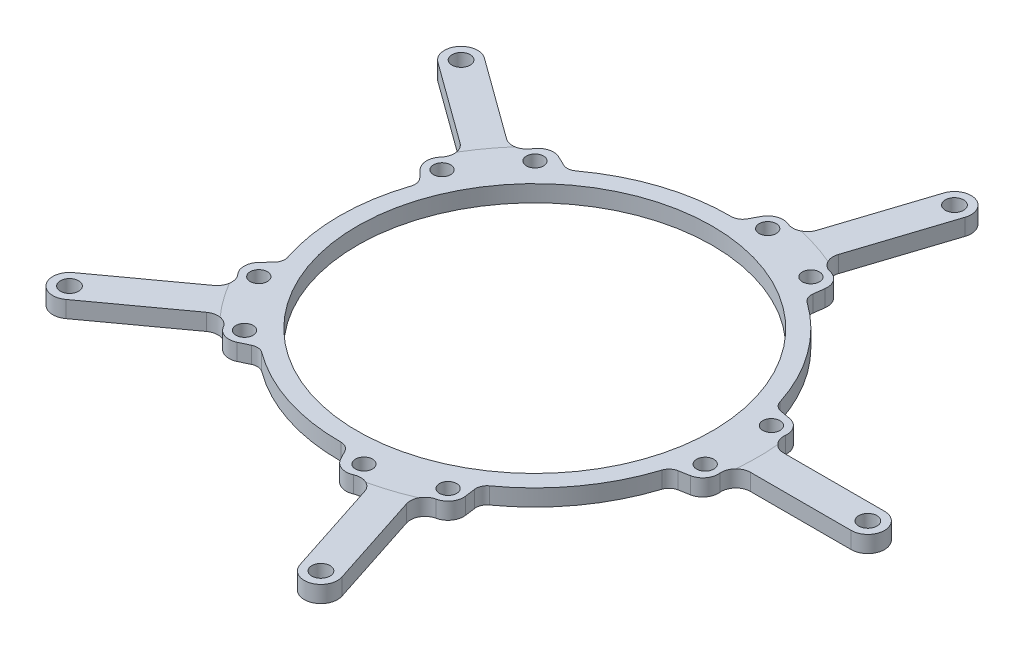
ISO-10303-21;
HEADER;
FILE_DESCRIPTION(('STEP AP214'),'2;1');
FILE_NAME('part.step','',(''),(''),'','','');
FILE_SCHEMA(('AUTOMOTIVE_DESIGN { 1 0 10303 214 1 1 1 1 }'));
ENDSEC;
DATA;
#1=APPLICATION_CONTEXT('core data for automotive mechanical design processes');
#2=APPLICATION_PROTOCOL_DEFINITION('international standard','automotive_design',2000,#1);
#3=PRODUCT_CONTEXT('',#1,'mechanical');
#4=PRODUCT('Part','Part','',(#3));
#5=PRODUCT_RELATED_PRODUCT_CATEGORY('part','',(#4));
#6=PRODUCT_DEFINITION_FORMATION('','',#4);
#7=PRODUCT_DEFINITION_CONTEXT('part definition',#1,'design');
#8=PRODUCT_DEFINITION('design','',#6,#7);
#9=PRODUCT_DEFINITION_SHAPE('','',#8);
#10=(LENGTH_UNIT() NAMED_UNIT(*) SI_UNIT(.MILLI.,.METRE.));
#11=(NAMED_UNIT(*) PLANE_ANGLE_UNIT() SI_UNIT($,.RADIAN.));
#12=(NAMED_UNIT(*) SI_UNIT($,.STERADIAN.) SOLID_ANGLE_UNIT());
#13=UNCERTAINTY_MEASURE_WITH_UNIT(LENGTH_MEASURE(1.E-05),#10,'distance_accuracy_value','');
#14=(GEOMETRIC_REPRESENTATION_CONTEXT(3) GLOBAL_UNCERTAINTY_ASSIGNED_CONTEXT((#13)) GLOBAL_UNIT_ASSIGNED_CONTEXT((#10,
#11,#12)) REPRESENTATION_CONTEXT('',''));
#15=CARTESIAN_POINT('',(0.,0.,0.));
#16=DIRECTION('',(0.,0.,1.));
#17=DIRECTION('',(1.,0.,0.));
#18=AXIS2_PLACEMENT_3D('',#15,#16,#17);
#19=CARTESIAN_POINT('',(0.,4.7625,0.));
#20=DIRECTION('',(0.,1.,0.));
#21=DIRECTION('',(0.,0.,1.));
#22=AXIS2_PLACEMENT_3D('',#19,#20,#21);
#23=PLANE('',#22);
#24=CARTESIAN_POINT('',(-59.0879375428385,4.7625,31.8440472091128));
#25=DIRECTION('',(0.,1.,0.));
#26=DIRECTION('',(0.587785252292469,0.,-0.809016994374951));
#27=AXIS2_PLACEMENT_3D('',#24,#25,#26);
#28=CIRCLE('',#27,4.2061429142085);
#29=CARTESIAN_POINT('',(-56.6156287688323,4.7625,35.2468883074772));
#30=VERTEX_POINT('',#29);
#31=CARTESIAN_POINT('',(-54.9309029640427,4.7625,32.4849073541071));
#32=VERTEX_POINT('',#31);
#33=EDGE_CURVE('E593',#30,#32,#28,.T.);
#34=ORIENTED_EDGE('',*,*,#33,.F.);
#35=DIRECTION('',(-0.809016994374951,0.,0.587785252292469));
#36=VECTOR('',#35,1.);
#37=CARTESIAN_POINT('',(-79.9198430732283,4.7625,52.1783910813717));
#38=LINE('',#37,#36);
#39=CARTESIAN_POINT('',(-79.9198430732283,4.7625,52.1783910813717));
#40=VERTEX_POINT('',#39);
#41=EDGE_CURVE('E1106',#30,#40,#38,.T.);
#42=ORIENTED_EDGE('',*,*,#41,.T.);
#43=CARTESIAN_POINT('',(-77.1205158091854,4.7625,56.0313345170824));
#44=DIRECTION('',(0.,1.,0.));
#45=DIRECTION('',(0.,0.,1.));
#46=AXIS2_PLACEMENT_3D('',#43,#44,#45);
#47=CIRCLE('',#46,4.7625);
#48=CARTESIAN_POINT('',(-74.3211885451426,4.7625,59.8842779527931));
#49=VERTEX_POINT('',#48);
#50=EDGE_CURVE('E1121',#40,#49,#47,.T.);
#51=ORIENTED_EDGE('',*,*,#50,.T.);
#52=DIRECTION('',(0.809016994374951,0.,-0.587785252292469));
#53=VECTOR('',#52,1.);
#54=CARTESIAN_POINT('',(-74.3211885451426,4.7625,59.8842779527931));
#55=LINE('',#54,#53);
#56=CARTESIAN_POINT('',(-51.0169742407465,4.7625,42.9527751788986));
#57=VERTEX_POINT('',#56);
#58=EDGE_CURVE('E1116',#49,#57,#55,.T.);
#59=ORIENTED_EDGE('',*,*,#58,.T.);
#60=CARTESIAN_POINT('',(-48.5446654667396,4.7625,46.3556162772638));
#61=DIRECTION('',(0.,1.,0.));
#62=DIRECTION('',(0.58778525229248,0.,0.809016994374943));
#63=AXIS2_PLACEMENT_3D('',#60,#61,#62);
#64=CIRCLE('',#63,4.20614291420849);
#65=CARTESIAN_POINT('',(-47.8695653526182,4.7625,42.2040047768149));
#66=VERTEX_POINT('',#65);
#67=EDGE_CURVE('E667',#66,#57,#64,.T.);
#68=ORIENTED_EDGE('',*,*,#67,.F.);
#69=CARTESIAN_POINT('',(0.,4.7625,0.));
#70=DIRECTION('',(0.,1.,0.));
#71=DIRECTION('',(0.,0.,1.));
#72=AXIS2_PLACEMENT_3D('',#69,#70,#71);
#73=CIRCLE('',#72,63.8175);
#74=EDGE_CURVE('E13',#66,#32,#73,.F.);
#75=ORIENTED_EDGE('',*,*,#74,.T.);
#76=EDGE_LOOP('',(#34,#42,#51,#59,#68,#75));
#77=FACE_BOUND('',#76,.T.);
#78=CARTESIAN_POINT('',(-77.1205158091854,4.7625,56.0313345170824));
#79=DIRECTION('',(0.,1.,0.));
#80=DIRECTION('',(0.,0.,1.));
#81=AXIS2_PLACEMENT_3D('',#78,#79,#80);
#82=CIRCLE('',#81,2.60985);
#83=CARTESIAN_POINT('',(-77.1205158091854,4.7625,58.6411845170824));
#84=VERTEX_POINT('',#83);
#85=EDGE_CURVE('E1040',#84,#84,#82,.T.);
#86=ORIENTED_EDGE('',*,*,#85,.F.);
#87=EDGE_LOOP('',(#86));
#88=FACE_BOUND('',#87,.T.);
#89=ADVANCED_FACE('F54',(#77,#88),#23,.T.);
#90=CARTESIAN_POINT('',(-59.0879375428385,4.7625,-31.8440472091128));
#91=DIRECTION('',(0.,1.,0.));
#92=DIRECTION('',(-0.587785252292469,0.,0.809016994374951));
#93=AXIS2_PLACEMENT_3D('',#90,#91,#92);
#94=CIRCLE('',#93,4.20614291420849);
#95=CARTESIAN_POINT('',(-54.9309029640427,4.7625,-32.4849073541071));
#96=VERTEX_POINT('',#95);
#97=CARTESIAN_POINT('',(-56.6156287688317,4.7625,-35.246888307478));
#98=VERTEX_POINT('',#97);
#99=EDGE_CURVE('E589',#96,#98,#94,.T.);
#100=ORIENTED_EDGE('',*,*,#99,.F.);
#101=CARTESIAN_POINT('',(-47.8695653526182,4.7625,-42.2040047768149));
#102=VERTEX_POINT('',#101);
#103=EDGE_CURVE('E64',#96,#102,#73,.F.);
#104=ORIENTED_EDGE('',*,*,#103,.T.);
#105=CARTESIAN_POINT('',(-48.5446654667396,4.7625,-46.3556162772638));
#106=DIRECTION('',(0.,1.,0.));
#107=DIRECTION('',(0.951056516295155,0.,0.309016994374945));
#108=AXIS2_PLACEMENT_3D('',#105,#106,#107);
#109=CIRCLE('',#108,4.2061429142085);
#110=CARTESIAN_POINT('',(-51.0169742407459,4.7625,-42.9527751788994));
#111=VERTEX_POINT('',#110);
#112=EDGE_CURVE('E845',#111,#102,#109,.T.);
#113=ORIENTED_EDGE('',*,*,#112,.F.);
#114=DIRECTION('',(-0.809016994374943,0.,-0.58778525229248));
#115=VECTOR('',#114,1.);
#116=CARTESIAN_POINT('',(-74.3211885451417,4.7625,-59.8842779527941));
#117=LINE('',#116,#115);
#118=CARTESIAN_POINT('',(-74.3211885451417,4.7625,-59.8842779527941));
#119=VERTEX_POINT('',#118);
#120=EDGE_CURVE('E1084',#111,#119,#117,.T.);
#121=ORIENTED_EDGE('',*,*,#120,.T.);
#122=CARTESIAN_POINT('',(-77.1205158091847,4.7625,-56.0313345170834));
#123=DIRECTION('',(0.,1.,0.));
#124=DIRECTION('',(0.,0.,1.));
#125=AXIS2_PLACEMENT_3D('',#122,#123,#124);
#126=CIRCLE('',#125,4.7625);
#127=CARTESIAN_POINT('',(-79.9198430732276,4.7625,-52.1783910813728));
#128=VERTEX_POINT('',#127);
#129=EDGE_CURVE('E1096',#119,#128,#126,.T.);
#130=ORIENTED_EDGE('',*,*,#129,.T.);
#131=DIRECTION('',(0.809016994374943,0.,0.587785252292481));
#132=VECTOR('',#131,1.);
#133=CARTESIAN_POINT('',(-79.9198430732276,4.7625,-52.1783910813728));
#134=LINE('',#133,#132);
#135=EDGE_CURVE('E1092',#128,#98,#134,.T.);
#136=ORIENTED_EDGE('',*,*,#135,.T.);
#137=EDGE_LOOP('',(#100,#104,#113,#121,#130,#136));
#138=FACE_BOUND('',#137,.T.);
#139=CARTESIAN_POINT('',(-77.1205158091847,4.7625,-56.0313345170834));
#140=DIRECTION('',(0.,1.,0.));
#141=DIRECTION('',(0.,0.,1.));
#142=AXIS2_PLACEMENT_3D('',#139,#140,#141);
#143=CIRCLE('',#142,2.60985);
#144=CARTESIAN_POINT('',(-77.1205158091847,4.7625,-53.4214845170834));
#145=VERTEX_POINT('',#144);
#146=EDGE_CURVE('E1034',#145,#145,#143,.T.);
#147=ORIENTED_EDGE('',*,*,#146,.F.);
#148=EDGE_LOOP('',(#147));
#149=FACE_BOUND('',#148,.T.);
#150=ADVANCED_FACE('F1273',(#138,#149),#23,.T.);
#151=CARTESIAN_POINT('',(12.0263117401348,4.7625,-66.0363197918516));
#152=DIRECTION('',(0.,1.,0.));
#153=DIRECTION('',(-0.951056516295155,0.,-0.309016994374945));
#154=AXIS2_PLACEMENT_3D('',#151,#152,#153);
#155=CIRCLE('',#154,4.20614291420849);
#156=CARTESIAN_POINT('',(13.9204002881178,4.7625,-62.2807816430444));
#157=VERTEX_POINT('',#156);
#158=CARTESIAN_POINT('',(16.0265913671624,4.7625,-64.7365501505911));
#159=VERTEX_POINT('',#158);
#160=EDGE_CURVE('E84',#157,#159,#155,.T.);
#161=ORIENTED_EDGE('',*,*,#160,.F.);
#162=CARTESIAN_POINT('',(25.3458845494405,4.7625,-58.5684167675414));
#163=VERTEX_POINT('',#162);
#164=EDGE_CURVE('E1253',#157,#163,#73,.F.);
#165=ORIENTED_EDGE('',*,*,#164,.T.);
#166=CARTESIAN_POINT('',(29.0856843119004,4.7625,-60.4933936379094));
#167=DIRECTION('',(0.,1.,0.));
#168=DIRECTION('',(0.,0.,1.));
#169=AXIS2_PLACEMENT_3D('',#166,#167,#168);
#170=CIRCLE('',#169,4.2061429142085);
#171=CARTESIAN_POINT('',(25.0854046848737,4.7625,-61.7931632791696));
#172=VERTEX_POINT('',#171);
#173=EDGE_CURVE('E925',#172,#163,#170,.T.);
#174=ORIENTED_EDGE('',*,*,#173,.F.);
#175=DIRECTION('',(0.309016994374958,0.,-0.951056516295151));
#176=VECTOR('',#175,1.);
#177=CARTESIAN_POINT('',(33.9868224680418,4.7625,-89.1889102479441));
#178=LINE('',#177,#176);
#179=CARTESIAN_POINT('',(33.9868224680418,4.7625,-89.1889102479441));
#180=VERTEX_POINT('',#179);
#181=EDGE_CURVE('E1060',#172,#180,#178,.T.);
#182=ORIENTED_EDGE('',*,*,#181,.T.);
#183=CARTESIAN_POINT('',(29.4574158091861,4.7625,-90.6606036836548));
#184=DIRECTION('',(0.,1.,0.));
#185=DIRECTION('',(0.,0.,1.));
#186=AXIS2_PLACEMENT_3D('',#183,#184,#185);
#187=CIRCLE('',#186,4.7625);
#188=CARTESIAN_POINT('',(24.9280091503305,4.7625,-92.1322971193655));
#189=VERTEX_POINT('',#188);
#190=EDGE_CURVE('E1074',#180,#189,#187,.T.);
#191=ORIENTED_EDGE('',*,*,#190,.T.);
#192=DIRECTION('',(-0.309016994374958,0.,0.951056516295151));
#193=VECTOR('',#192,1.);
#194=CARTESIAN_POINT('',(24.9280091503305,4.7625,-92.1322971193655));
#195=LINE('',#194,#193);
#196=EDGE_CURVE('E1069',#189,#159,#195,.T.);
#197=ORIENTED_EDGE('',*,*,#196,.T.);
#198=EDGE_LOOP('',(#161,#165,#174,#182,#191,#197));
#199=FACE_BOUND('',#198,.T.);
#200=CARTESIAN_POINT('',(29.4574158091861,4.7625,-90.6606036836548));
#201=DIRECTION('',(0.,1.,0.));
#202=DIRECTION('',(0.,0.,1.));
#203=AXIS2_PLACEMENT_3D('',#200,#201,#202);
#204=CIRCLE('',#203,2.60985);
#205=CARTESIAN_POINT('',(29.4574158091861,4.7625,-88.0507536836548));
#206=VERTEX_POINT('',#205);
#207=EDGE_CURVE('E1028',#206,#206,#204,.T.);
#208=ORIENTED_EDGE('',*,*,#207,.F.);
#209=EDGE_LOOP('',(#208));
#210=FACE_BOUND('',#209,.T.);
#211=ADVANCED_FACE('F1371',(#199,#210),#23,.T.);
#212=CARTESIAN_POINT('',(66.5206069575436,4.7625,8.96864291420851));
#213=DIRECTION('',(0.,1.,0.));
#214=DIRECTION('',(-0.95105651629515,0.,0.309016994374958));
#215=AXIS2_PLACEMENT_3D('',#212,#213,#214);
#216=CIRCLE('',#215,4.2061429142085);
#217=CARTESIAN_POINT('',(66.5206069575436,4.7625,4.7625));
#218=VERTEX_POINT('',#217);
#219=CARTESIAN_POINT('',(63.5341834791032,4.7625,6.00673254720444));
#220=VERTEX_POINT('',#219);
#221=EDGE_CURVE('E761',#218,#220,#216,.T.);
#222=ORIENTED_EDGE('',*,*,#221,.F.);
#223=DIRECTION('',(1.,0.,0.));
#224=VECTOR('',#223,1.);
#225=CARTESIAN_POINT('',(95.3262,4.76250000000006,4.76249999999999));
#226=LINE('',#225,#224);
#227=CARTESIAN_POINT('',(95.3262,4.76250000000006,4.76249999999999));
#228=VERTEX_POINT('',#227);
#229=EDGE_CURVE('E1181',#218,#228,#226,.T.);
#230=ORIENTED_EDGE('',*,*,#229,.T.);
#231=CARTESIAN_POINT('',(95.3262,4.76250000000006,0.));
#232=DIRECTION('',(0.,1.,0.));
#233=DIRECTION('',(0.,0.,1.));
#234=AXIS2_PLACEMENT_3D('',#231,#232,#233);
#235=CIRCLE('',#234,4.7625);
#236=CARTESIAN_POINT('',(95.3262,4.76250000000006,-4.76250000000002));
#237=VERTEX_POINT('',#236);
#238=EDGE_CURVE('E1193',#228,#237,#235,.T.);
#239=ORIENTED_EDGE('',*,*,#238,.T.);
#240=DIRECTION('',(-1.,0.,0.));
#241=VECTOR('',#240,1.);
#242=CARTESIAN_POINT('',(95.3262,4.76250000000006,-4.76250000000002));
#243=LINE('',#242,#241);
#244=CARTESIAN_POINT('',(66.5206069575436,4.7625,-4.76250000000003));
#245=VERTEX_POINT('',#244);
#246=EDGE_CURVE('E1189',#237,#245,#243,.T.);
#247=ORIENTED_EDGE('',*,*,#246,.T.);
#248=CARTESIAN_POINT('',(66.5206069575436,4.7625,-8.96864291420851));
#249=DIRECTION('',(0.,1.,0.));
#250=DIRECTION('',(0.,0.,-1.));
#251=AXIS2_PLACEMENT_3D('',#248,#249,#250);
#252=CIRCLE('',#251,4.20614291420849);
#253=CARTESIAN_POINT('',(63.5341834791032,4.7625,-6.00673254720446));
#254=VERTEX_POINT('',#253);
#255=EDGE_CURVE('E921',#254,#245,#252,.T.);
#256=ORIENTED_EDGE('',*,*,#255,.F.);
#257=EDGE_CURVE('E1244',#254,#220,#73,.F.);
#258=ORIENTED_EDGE('',*,*,#257,.T.);
#259=EDGE_LOOP('',(#222,#230,#239,#247,#256,#258));
#260=FACE_BOUND('',#259,.T.);
#261=CARTESIAN_POINT('',(95.3262,4.76250000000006,0.));
#262=DIRECTION('',(0.,1.,0.));
#263=DIRECTION('',(0.,0.,1.));
#264=AXIS2_PLACEMENT_3D('',#261,#262,#263);
#265=CIRCLE('',#264,2.60985);
#266=CARTESIAN_POINT('',(95.3262,4.76250000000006,2.60984999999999));
#267=VERTEX_POINT('',#266);
#268=EDGE_CURVE('E1172',#267,#267,#265,.T.);
#269=ORIENTED_EDGE('',*,*,#268,.F.);
#270=EDGE_LOOP('',(#269));
#271=FACE_BOUND('',#270,.T.);
#272=ADVANCED_FACE('F1383',(#260,#271),#23,.T.);
#273=CARTESIAN_POINT('',(12.0263117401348,4.7625,66.0363197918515));
#274=DIRECTION('',(0.,1.,0.));
#275=DIRECTION('',(-0.58778525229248,0.,-0.809016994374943));
#276=AXIS2_PLACEMENT_3D('',#273,#274,#275);
#277=CIRCLE('',#276,4.2061429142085);
#278=CARTESIAN_POINT('',(16.0265913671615,4.7625,64.7365501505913));
#279=VERTEX_POINT('',#278);
#280=CARTESIAN_POINT('',(13.9204002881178,4.7625,62.2807816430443));
#281=VERTEX_POINT('',#280);
#282=EDGE_CURVE('E672',#279,#281,#277,.T.);
#283=ORIENTED_EDGE('',*,*,#282,.F.);
#284=DIRECTION('',(0.309016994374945,0.,0.951056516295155));
#285=VECTOR('',#284,1.);
#286=CARTESIAN_POINT('',(24.9280091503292,4.7625,92.1322971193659));
#287=LINE('',#286,#285);
#288=CARTESIAN_POINT('',(24.9280091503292,4.7625,92.1322971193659));
#289=VERTEX_POINT('',#288);
#290=EDGE_CURVE('E1135',#279,#289,#287,.T.);
#291=ORIENTED_EDGE('',*,*,#290,.T.);
#292=CARTESIAN_POINT('',(29.4574158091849,4.7625,90.6606036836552));
#293=DIRECTION('',(0.,1.,0.));
#294=DIRECTION('',(0.,0.,1.));
#295=AXIS2_PLACEMENT_3D('',#292,#293,#294);
#296=CIRCLE('',#295,4.7625);
#297=CARTESIAN_POINT('',(33.9868224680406,4.76250000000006,89.1889102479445));
#298=VERTEX_POINT('',#297);
#299=EDGE_CURVE('E1150',#289,#298,#296,.T.);
#300=ORIENTED_EDGE('',*,*,#299,.T.);
#301=DIRECTION('',(-0.309016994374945,0.,-0.951056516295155));
#302=VECTOR('',#301,1.);
#303=CARTESIAN_POINT('',(33.9868224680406,4.7625,89.1889102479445));
#304=LINE('',#303,#302);
#305=CARTESIAN_POINT('',(25.0854046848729,4.7625,61.79316327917));
#306=VERTEX_POINT('',#305);
#307=EDGE_CURVE('E1145',#298,#306,#304,.T.);
#308=ORIENTED_EDGE('',*,*,#307,.T.);
#309=CARTESIAN_POINT('',(29.0856843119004,4.7625,60.4933936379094));
#310=DIRECTION('',(0.,1.,0.));
#311=DIRECTION('',(0.95105651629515,0.,-0.309016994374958));
#312=AXIS2_PLACEMENT_3D('',#309,#310,#311);
#313=CIRCLE('',#312,4.20614291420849);
#314=CARTESIAN_POINT('',(25.3458845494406,4.7625,58.5684167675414));
#315=VERTEX_POINT('',#314);
#316=EDGE_CURVE('E756',#315,#306,#313,.T.);
#317=ORIENTED_EDGE('',*,*,#316,.F.);
#318=EDGE_CURVE('E58',#315,#281,#73,.F.);
#319=ORIENTED_EDGE('',*,*,#318,.T.);
#320=EDGE_LOOP('',(#283,#291,#300,#308,#317,#319));
#321=FACE_BOUND('',#320,.T.);
#322=CARTESIAN_POINT('',(29.4574158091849,4.7625,90.6606036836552));
#323=DIRECTION('',(0.,1.,0.));
#324=DIRECTION('',(0.,0.,1.));
#325=AXIS2_PLACEMENT_3D('',#322,#323,#324);
#326=CIRCLE('',#325,2.60985);
#327=CARTESIAN_POINT('',(29.4574158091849,4.7625,93.2704536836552));
#328=VERTEX_POINT('',#327);
#329=EDGE_CURVE('E1048',#328,#328,#326,.T.);
#330=ORIENTED_EDGE('',*,*,#329,.F.);
#331=EDGE_LOOP('',(#330));
#332=FACE_BOUND('',#331,.T.);
#333=ADVANCED_FACE('F1375',(#321,#332),#23,.T.);
#334=CARTESIAN_POINT('',(0.,0.,0.));
#335=DIRECTION('',(0.,1.,0.));
#336=DIRECTION('',(0.,0.,1.));
#337=AXIS2_PLACEMENT_3D('',#334,#335,#336);
#338=PLANE('',#337);
#339=DIRECTION('',(-0.809016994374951,0.,0.587785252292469));
#340=VECTOR('',#339,1.);
#341=CARTESIAN_POINT('',(-79.9198430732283,0.,52.1783910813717));
#342=LINE('',#341,#340);
#343=CARTESIAN_POINT('',(-56.6156287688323,0.,35.2468883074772));
#344=VERTEX_POINT('',#343);
#345=CARTESIAN_POINT('',(-79.9198430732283,0.,52.1783910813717));
#346=VERTEX_POINT('',#345);
#347=EDGE_CURVE('E1103',#344,#346,#342,.T.);
#348=ORIENTED_EDGE('',*,*,#347,.F.);
#349=CARTESIAN_POINT('',(-59.0879375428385,0.,31.8440472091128));
#350=DIRECTION('',(0.,1.,0.));
#351=DIRECTION('',(0.,0.,1.));
#352=AXIS2_PLACEMENT_3D('',#349,#350,#351);
#353=CIRCLE('',#352,4.2061429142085);
#354=CARTESIAN_POINT('',(-55.9441263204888,0.,29.0497513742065));
#355=VERTEX_POINT('',#354);
#356=EDGE_CURVE('E580',#355,#344,#353,.F.);
#357=ORIENTED_EDGE('',*,*,#356,.F.);
#358=CARTESIAN_POINT('',(-52.6217853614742,0.,26.0967739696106));
#359=DIRECTION('',(0.,1.,0.));
#360=DIRECTION('',(0.,0.,1.));
#361=AXIS2_PLACEMENT_3D('',#358,#359,#360);
#362=CIRCLE('',#361,4.445);
#363=CARTESIAN_POINT('',(-55.8395647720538,0.,23.03019270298));
#364=VERTEX_POINT('',#363);
#365=EDGE_CURVE('E576',#364,#355,#362,.T.);
#366=ORIENTED_EDGE('',*,*,#365,.F.);
#367=DIRECTION('',(-0.689894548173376,0.,0.723909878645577));
#368=VECTOR('',#367,1.);
#369=CARTESIAN_POINT('',(-55.8395647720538,0.,23.03019270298));
#370=LINE('',#369,#368);
#371=CARTESIAN_POINT('',(-53.7390928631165,0.,20.8261567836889));
#372=VERTEX_POINT('',#371);
#373=EDGE_CURVE('E572',#372,#364,#370,.T.);
#374=ORIENTED_EDGE('',*,*,#373,.F.);
#375=CARTESIAN_POINT('',(-56.0375067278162,0.,18.6357415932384));
#376=DIRECTION('',(0.,1.,0.));
#377=DIRECTION('',(0.,0.,1.));
#378=AXIS2_PLACEMENT_3D('',#375,#376,#377);
#379=CIRCLE('',#378,3.175);
#380=CARTESIAN_POINT('',(-53.0247375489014,0.,17.6338200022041));
#381=VERTEX_POINT('',#380);
#382=EDGE_CURVE('E562',#381,#372,#379,.F.);
#383=ORIENTED_EDGE('',*,*,#382,.F.);
#384=CARTESIAN_POINT('',(0.,0.,0.));
#385=DIRECTION('',(0.,1.,0.));
#386=DIRECTION('',(0.,0.,1.));
#387=AXIS2_PLACEMENT_3D('',#384,#385,#386);
#388=CIRCLE('',#387,55.88);
#389=CARTESIAN_POINT('',(-53.0247375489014,0.,-17.6338200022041));
#390=VERTEX_POINT('',#389);
#391=EDGE_CURVE('E559',#390,#381,#388,.T.);
#392=ORIENTED_EDGE('',*,*,#391,.F.);
#393=CARTESIAN_POINT('',(-56.0375067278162,0.,-18.6357415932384));
#394=DIRECTION('',(0.,1.,0.));
#395=DIRECTION('',(0.,0.,1.));
#396=AXIS2_PLACEMENT_3D('',#393,#394,#395);
#397=CIRCLE('',#396,3.17499999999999);
#398=CARTESIAN_POINT('',(-53.7390928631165,0.,-20.8261567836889));
#399=VERTEX_POINT('',#398);
#400=EDGE_CURVE('E536',#399,#390,#397,.F.);
#401=ORIENTED_EDGE('',*,*,#400,.F.);
#402=DIRECTION('',(0.689894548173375,0.,0.723909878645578));
#403=VECTOR('',#402,1.);
#404=CARTESIAN_POINT('',(-55.8395647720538,0.,-23.03019270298));
#405=LINE('',#404,#403);
#406=CARTESIAN_POINT('',(-55.8395647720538,0.,-23.03019270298));
#407=VERTEX_POINT('',#406);
#408=EDGE_CURVE('E547',#407,#399,#405,.T.);
#409=ORIENTED_EDGE('',*,*,#408,.F.);
#410=CARTESIAN_POINT('',(-52.6217853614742,0.,-26.0967739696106));
#411=DIRECTION('',(0.,1.,0.));
#412=DIRECTION('',(0.,0.,1.));
#413=AXIS2_PLACEMENT_3D('',#410,#411,#412);
#414=CIRCLE('',#413,4.445);
#415=CARTESIAN_POINT('',(-55.9441263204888,0.,-29.0497513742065));
#416=VERTEX_POINT('',#415);
#417=EDGE_CURVE('E565',#416,#407,#414,.T.);
#418=ORIENTED_EDGE('',*,*,#417,.F.);
#419=CARTESIAN_POINT('',(-59.0879375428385,0.,-31.8440472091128));
#420=DIRECTION('',(0.,1.,0.));
#421=DIRECTION('',(0.,0.,1.));
#422=AXIS2_PLACEMENT_3D('',#419,#420,#421);
#423=CIRCLE('',#422,4.20614291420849);
#424=CARTESIAN_POINT('',(-56.6156287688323,0.,-35.2468883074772));
#425=VERTEX_POINT('',#424);
#426=EDGE_CURVE('E560',#425,#416,#423,.F.);
#427=ORIENTED_EDGE('',*,*,#426,.F.);
#428=DIRECTION('',(0.809016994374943,0.,0.58778525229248));
#429=VECTOR('',#428,1.);
#430=CARTESIAN_POINT('',(-79.9198430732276,0.,-52.1783910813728));
#431=LINE('',#430,#429);
#432=CARTESIAN_POINT('',(-79.9198430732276,0.,-52.1783910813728));
#433=VERTEX_POINT('',#432);
#434=EDGE_CURVE('E1085',#433,#425,#431,.T.);
#435=ORIENTED_EDGE('',*,*,#434,.F.);
#436=CARTESIAN_POINT('',(-77.1205158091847,0.,-56.0313345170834));
#437=DIRECTION('',(0.,1.,0.));
#438=DIRECTION('',(0.587785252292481,0.,-0.809016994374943));
#439=AXIS2_PLACEMENT_3D('',#436,#437,#438);
#440=CIRCLE('',#439,4.7625);
#441=CARTESIAN_POINT('',(-74.3211885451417,0.,-59.8842779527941));
#442=VERTEX_POINT('',#441);
#443=EDGE_CURVE('E1089',#442,#433,#440,.T.);
#444=ORIENTED_EDGE('',*,*,#443,.F.);
#445=DIRECTION('',(-0.809016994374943,0.,-0.58778525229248));
#446=VECTOR('',#445,1.);
#447=CARTESIAN_POINT('',(-74.3211885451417,0.,-59.8842779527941));
#448=LINE('',#447,#446);
#449=CARTESIAN_POINT('',(-51.0169742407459,0.,-42.9527751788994));
#450=VERTEX_POINT('',#449);
#451=EDGE_CURVE('E1082',#450,#442,#448,.T.);
#452=ORIENTED_EDGE('',*,*,#451,.F.);
#453=CARTESIAN_POINT('',(-48.5446654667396,0.,-46.3556162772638));
#454=DIRECTION('',(0.,1.,0.));
#455=DIRECTION('',(0.,0.,1.));
#456=AXIS2_PLACEMENT_3D('',#453,#454,#455);
#457=CIRCLE('',#456,4.2061429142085);
#458=CARTESIAN_POINT('',(-44.9156411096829,0.,-44.2291590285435));
#459=VERTEX_POINT('',#458);
#460=EDGE_CURVE('E827',#459,#450,#457,.F.);
#461=ORIENTED_EDGE('',*,*,#460,.F.);
#462=CARTESIAN_POINT('',(-41.0805328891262,0.,-41.9819452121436));
#463=DIRECTION('',(0.,1.,0.));
#464=DIRECTION('',(0.,0.,1.));
#465=AXIS2_PLACEMENT_3D('',#462,#463,#464);
#466=CIRCLE('',#465,4.445);
#467=CARTESIAN_POINT('',(-39.1583893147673,0.,-45.9898610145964));
#468=VERTEX_POINT('',#467);
#469=EDGE_CURVE('E824',#468,#459,#466,.T.);
#470=ORIENTED_EDGE('',*,*,#469,.F.);
#471=DIRECTION('',(-0.901668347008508,0.,-0.432428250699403));
#472=VECTOR('',#471,1.);
#473=CARTESIAN_POINT('',(-39.1583893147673,0.,-45.9898610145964));
#474=LINE('',#473,#472);
#475=CARTESIAN_POINT('',(-36.4131450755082,0.,-44.6732780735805));
#476=VERTEX_POINT('',#475);
#477=EDGE_CURVE('E821',#476,#468,#474,.T.);
#478=ORIENTED_EDGE('',*,*,#477,.F.);
#479=CARTESIAN_POINT('',(-35.0401853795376,0.,-47.5360750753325));
#480=DIRECTION('',(0.,1.,0.));
#481=DIRECTION('',(0.,0.,1.));
#482=AXIS2_PLACEMENT_3D('',#479,#480,#481);
#483=CIRCLE('',#482,3.175);
#484=CARTESIAN_POINT('',(-33.1563044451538,0.,-44.9803721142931));
#485=VERTEX_POINT('',#484);
#486=EDGE_CURVE('E818',#485,#476,#483,.F.);
#487=ORIENTED_EDGE('',*,*,#486,.F.);
#488=CARTESIAN_POINT('',(0.,0.,0.));
#489=DIRECTION('',(0.,1.,0.));
#490=DIRECTION('',(0.,0.,1.));
#491=AXIS2_PLACEMENT_3D('',#488,#489,#490);
#492=CIRCLE('',#491,55.88);
#493=CARTESIAN_POINT('',(0.385214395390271,0.,-55.8786722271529));
#494=VERTEX_POINT('',#493);
#495=EDGE_CURVE('E814',#494,#485,#492,.T.);
#496=ORIENTED_EDGE('',*,*,#495,.F.);
#497=CARTESIAN_POINT('',(0.407101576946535,0.,-59.0535967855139));
#498=DIRECTION('',(0.,1.,0.));
#499=DIRECTION('',(0.,0.,1.));
#500=AXIS2_PLACEMENT_3D('',#497,#498,#499);
#501=CIRCLE('',#500,3.17499999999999);
#502=CARTESIAN_POINT('',(3.20055916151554,0.,-57.5445508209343));
#503=VERTEX_POINT('',#502);
#504=EDGE_CURVE('E810',#503,#494,#501,.F.);
#505=ORIENTED_EDGE('',*,*,#504,.F.);
#506=DIRECTION('',(-0.475290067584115,0.,0.879829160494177));
#507=VECTOR('',#506,1.);
#508=CARTESIAN_POINT('',(4.64764036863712,0.,-60.2233028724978));
#509=LINE('',#508,#507);
#510=CARTESIAN_POINT('',(4.64764036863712,0.,-60.2233028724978));
#511=VERTEX_POINT('',#510);
#512=EDGE_CURVE('E865',#511,#503,#509,.T.);
#513=ORIENTED_EDGE('',*,*,#512,.F.);
#514=CARTESIAN_POINT('',(8.55848098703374,0.,-58.1106385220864));
#515=DIRECTION('',(0.,1.,0.));
#516=DIRECTION('',(0.,0.,1.));
#517=AXIS2_PLACEMENT_3D('',#514,#515,#516);
#518=CIRCLE('',#517,4.445);
#519=CARTESIAN_POINT('',(10.3402695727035,0.,-62.1828927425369));
#520=VERTEX_POINT('',#519);
#521=EDGE_CURVE('E552',#520,#511,#518,.T.);
#522=ORIENTED_EDGE('',*,*,#521,.F.);
#523=CARTESIAN_POINT('',(12.0263117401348,0.,-66.0363197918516));
#524=DIRECTION('',(0.,1.,0.));
#525=DIRECTION('',(0.,0.,1.));
#526=AXIS2_PLACEMENT_3D('',#523,#524,#525);
#527=CIRCLE('',#526,4.20614291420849);
#528=CARTESIAN_POINT('',(16.0265913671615,0.,-64.7365501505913));
#529=VERTEX_POINT('',#528);
#530=EDGE_CURVE('E806',#529,#520,#527,.F.);
#531=ORIENTED_EDGE('',*,*,#530,.F.);
#532=DIRECTION('',(-0.309016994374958,0.,0.951056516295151));
#533=VECTOR('',#532,1.);
#534=CARTESIAN_POINT('',(24.9280091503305,0.,-92.1322971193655));
#535=LINE('',#534,#533);
#536=CARTESIAN_POINT('',(24.9280091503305,0.,-92.1322971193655));
#537=VERTEX_POINT('',#536);
#538=EDGE_CURVE('E1061',#537,#529,#535,.T.);
#539=ORIENTED_EDGE('',*,*,#538,.F.);
#540=CARTESIAN_POINT('',(29.4574158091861,0.,-90.6606036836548));
#541=DIRECTION('',(0.,1.,0.));
#542=DIRECTION('',(0.951056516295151,0.,0.309016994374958));
#543=AXIS2_PLACEMENT_3D('',#540,#541,#542);
#544=CIRCLE('',#543,4.7625);
#545=CARTESIAN_POINT('',(33.9868224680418,0.,-89.1889102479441));
#546=VERTEX_POINT('',#545);
#547=EDGE_CURVE('E1066',#546,#537,#544,.T.);
#548=ORIENTED_EDGE('',*,*,#547,.F.);
#549=DIRECTION('',(0.309016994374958,0.,-0.951056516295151));
#550=VECTOR('',#549,1.);
#551=CARTESIAN_POINT('',(33.9868224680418,0.,-89.1889102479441));
#552=LINE('',#551,#550);
#553=CARTESIAN_POINT('',(25.0854046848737,0.,-61.7931632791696));
#554=VERTEX_POINT('',#553);
#555=EDGE_CURVE('E1057',#554,#546,#552,.T.);
#556=ORIENTED_EDGE('',*,*,#555,.F.);
#557=CARTESIAN_POINT('',(29.0856843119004,0.,-60.4933936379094));
#558=DIRECTION('',(0.,1.,0.));
#559=DIRECTION('',(0.,0.,1.));
#560=AXIS2_PLACEMENT_3D('',#557,#558,#559);
#561=CIRCLE('',#560,4.2061429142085);
#562=CARTESIAN_POINT('',(28.184733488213,0.,-56.3848749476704));
#563=VERTEX_POINT('',#562);
#564=EDGE_CURVE('E74',#563,#554,#561,.F.);
#565=ORIENTED_EDGE('',*,*,#564,.F.);
#566=CARTESIAN_POINT('',(27.2326197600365,0.,-52.0430430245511));
#567=DIRECTION('',(0.,1.,0.));
#568=DIRECTION('',(0.,0.,1.));
#569=AXIS2_PLACEMENT_3D('',#566,#567,#568);
#570=CIRCLE('',#569,4.445);
#571=CARTESIAN_POINT('',(31.6383492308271,0.,-51.453489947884));
#572=VERTEX_POINT('',#571);
#573=EDGE_CURVE('E906',#572,#563,#570,.T.);
#574=ORIENTED_EDGE('',*,*,#573,.F.);
#575=DIRECTION('',(0.132632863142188,0.,-0.991165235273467));
#576=VECTOR('',#575,1.);
#577=CARTESIAN_POINT('',(31.6383492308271,0.,-51.453489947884));
#578=LINE('',#577,#576);
#579=CARTESIAN_POINT('',(31.2345315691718,0.,-48.4357610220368));
#580=VERTEX_POINT('',#579);
#581=EDGE_CURVE('E902',#580,#572,#578,.T.);
#582=ORIENTED_EDGE('',*,*,#581,.F.);
#583=CARTESIAN_POINT('',(34.3814811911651,0.,-48.0146516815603));
#584=DIRECTION('',(0.,1.,0.));
#585=DIRECTION('',(0.,0.,1.));
#586=AXIS2_PLACEMENT_3D('',#583,#584,#585);
#587=CIRCLE('',#586,3.175);
#588=CARTESIAN_POINT('',(32.5330144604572,0.,-45.433218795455));
#589=VERTEX_POINT('',#588);
#590=EDGE_CURVE('E898',#589,#580,#587,.F.);
#591=ORIENTED_EDGE('',*,*,#590,.F.);
#592=CARTESIAN_POINT('',(0.,0.,0.));
#593=DIRECTION('',(0.,1.,0.));
#594=DIRECTION('',(0.,0.,1.));
#595=AXIS2_PLACEMENT_3D('',#592,#593,#594);
#596=CIRCLE('',#595,55.88);
#597=CARTESIAN_POINT('',(53.2628131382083,0.,-16.9010986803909));
#598=VERTEX_POINT('',#597);
#599=EDGE_CURVE('E894',#598,#589,#596,.T.);
#600=ORIENTED_EDGE('',*,*,#599,.F.);
#601=CARTESIAN_POINT('',(56.2891093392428,0.,-17.8613883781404));
#602=DIRECTION('',(0.,1.,0.));
#603=DIRECTION('',(0.,0.,1.));
#604=AXIS2_PLACEMENT_3D('',#601,#602,#603);
#605=CIRCLE('',#604,3.17499999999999);
#606=CARTESIAN_POINT('',(55.717147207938,0.,-14.7383314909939));
#607=VERTEX_POINT('',#606);
#608=EDGE_CURVE('E891',#607,#598,#605,.F.);
#609=ORIENTED_EDGE('',*,*,#608,.F.);
#610=DIRECTION('',(-0.98363996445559,0.,-0.180145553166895));
#611=VECTOR('',#610,1.);
#612=CARTESIAN_POINT('',(58.7119644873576,0.,-14.1898553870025));
#613=LINE('',#612,#611);
#614=CARTESIAN_POINT('',(58.7119644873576,0.,-14.1898553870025));
#615=VERTEX_POINT('',#614);
#616=EDGE_CURVE('E948',#615,#607,#613,.T.);
#617=ORIENTED_EDGE('',*,*,#616,.F.);
#618=CARTESIAN_POINT('',(57.9112175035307,0.,-9.81757574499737));
#619=DIRECTION('',(0.,1.,0.));
#620=DIRECTION('',(0.,0.,1.));
#621=AXIS2_PLACEMENT_3D('',#618,#619,#620);
#622=CIRCLE('',#621,4.445);
#623=CARTESIAN_POINT('',(62.3347643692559,0.,-9.38138985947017));
#624=VERTEX_POINT('',#623);
#625=EDGE_CURVE('E885',#624,#615,#622,.T.);
#626=ORIENTED_EDGE('',*,*,#625,.F.);
#627=CARTESIAN_POINT('',(66.5206069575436,0.,-8.96864291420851));
#628=DIRECTION('',(0.,1.,0.));
#629=DIRECTION('',(0.,0.,1.));
#630=AXIS2_PLACEMENT_3D('',#627,#628,#629);
#631=CIRCLE('',#630,4.20614291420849);
#632=CARTESIAN_POINT('',(66.5206069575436,0.,-4.76250000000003));
#633=VERTEX_POINT('',#632);
#634=EDGE_CURVE('E888',#633,#624,#631,.F.);
#635=ORIENTED_EDGE('',*,*,#634,.F.);
#636=DIRECTION('',(-1.,0.,0.));
#637=VECTOR('',#636,1.);
#638=CARTESIAN_POINT('',(95.3262,0.,-4.76250000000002));
#639=LINE('',#638,#637);
#640=CARTESIAN_POINT('',(95.3262,0.,-4.76250000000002));
#641=VERTEX_POINT('',#640);
#642=EDGE_CURVE('E1182',#641,#633,#639,.T.);
#643=ORIENTED_EDGE('',*,*,#642,.F.);
#644=CARTESIAN_POINT('',(95.3262,0.,0.));
#645=DIRECTION('',(0.,1.,0.));
#646=DIRECTION('',(0.,0.,1.));
#647=AXIS2_PLACEMENT_3D('',#644,#645,#646);
#648=CIRCLE('',#647,4.7625);
#649=CARTESIAN_POINT('',(95.3262,0.,4.76249999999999));
#650=VERTEX_POINT('',#649);
#651=EDGE_CURVE('E1186',#650,#641,#648,.T.);
#652=ORIENTED_EDGE('',*,*,#651,.F.);
#653=DIRECTION('',(1.,0.,0.));
#654=VECTOR('',#653,1.);
#655=CARTESIAN_POINT('',(95.3262,0.,4.76249999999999));
#656=LINE('',#655,#654);
#657=CARTESIAN_POINT('',(66.5206069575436,0.,4.7625));
#658=VERTEX_POINT('',#657);
#659=EDGE_CURVE('E1179',#658,#650,#656,.T.);
#660=ORIENTED_EDGE('',*,*,#659,.F.);
#661=CARTESIAN_POINT('',(66.5206069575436,0.,8.96864291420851));
#662=DIRECTION('',(0.,1.,0.));
#663=DIRECTION('',(0.,0.,1.));
#664=AXIS2_PLACEMENT_3D('',#661,#662,#663);
#665=CIRCLE('',#664,4.2061429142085);
#666=CARTESIAN_POINT('',(62.3347643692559,0.,9.38138985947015));
#667=VERTEX_POINT('',#666);
#668=EDGE_CURVE('E742',#667,#658,#665,.F.);
#669=ORIENTED_EDGE('',*,*,#668,.F.);
#670=CARTESIAN_POINT('',(57.9112175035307,0.,9.81757574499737));
#671=DIRECTION('',(0.,1.,0.));
#672=DIRECTION('',(0.,0.,1.));
#673=AXIS2_PLACEMENT_3D('',#670,#671,#672);
#674=CIRCLE('',#673,4.445);
#675=CARTESIAN_POINT('',(58.7119644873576,0.,14.1898553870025));
#676=VERTEX_POINT('',#675);
#677=EDGE_CURVE('E739',#676,#667,#674,.T.);
#678=ORIENTED_EDGE('',*,*,#677,.F.);
#679=DIRECTION('',(0.98363996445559,0.,-0.180145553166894));
#680=VECTOR('',#679,1.);
#681=CARTESIAN_POINT('',(58.7119644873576,0.,14.1898553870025));
#682=LINE('',#681,#680);
#683=CARTESIAN_POINT('',(55.717147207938,0.,14.7383314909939));
#684=VERTEX_POINT('',#683);
#685=EDGE_CURVE('E736',#684,#676,#682,.T.);
#686=ORIENTED_EDGE('',*,*,#685,.F.);
#687=CARTESIAN_POINT('',(56.2891093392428,0.,17.8613883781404));
#688=DIRECTION('',(0.,1.,0.));
#689=DIRECTION('',(0.,0.,1.));
#690=AXIS2_PLACEMENT_3D('',#687,#688,#689);
#691=CIRCLE('',#690,3.175);
#692=CARTESIAN_POINT('',(53.2628131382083,0.,16.9010986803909));
#693=VERTEX_POINT('',#692);
#694=EDGE_CURVE('E732',#693,#684,#691,.F.);
#695=ORIENTED_EDGE('',*,*,#694,.F.);
#696=CARTESIAN_POINT('',(0.,0.,0.));
#697=DIRECTION('',(0.,1.,0.));
#698=DIRECTION('',(0.,0.,1.));
#699=AXIS2_PLACEMENT_3D('',#696,#697,#698);
#700=CIRCLE('',#699,55.88);
#701=CARTESIAN_POINT('',(32.5330144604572,0.,45.433218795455));
#702=VERTEX_POINT('',#701);
#703=EDGE_CURVE('E728',#702,#693,#700,.T.);
#704=ORIENTED_EDGE('',*,*,#703,.F.);
#705=CARTESIAN_POINT('',(34.3814811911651,0.,48.0146516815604));
#706=DIRECTION('',(0.,1.,0.));
#707=DIRECTION('',(0.,0.,1.));
#708=AXIS2_PLACEMENT_3D('',#705,#706,#707);
#709=CIRCLE('',#708,3.17499999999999);
#710=CARTESIAN_POINT('',(31.2345315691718,0.,48.4357610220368));
#711=VERTEX_POINT('',#710);
#712=EDGE_CURVE('E724',#711,#702,#709,.F.);
#713=ORIENTED_EDGE('',*,*,#712,.F.);
#714=DIRECTION('',(-0.132632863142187,0.,-0.991165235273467));
#715=VECTOR('',#714,1.);
#716=CARTESIAN_POINT('',(31.6383492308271,0.,51.453489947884));
#717=LINE('',#716,#715);
#718=CARTESIAN_POINT('',(31.6383492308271,0.,51.453489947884));
#719=VERTEX_POINT('',#718);
#720=EDGE_CURVE('E628',#719,#711,#717,.T.);
#721=ORIENTED_EDGE('',*,*,#720,.F.);
#722=CARTESIAN_POINT('',(27.2326197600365,0.,52.0430430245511));
#723=DIRECTION('',(0.,1.,0.));
#724=DIRECTION('',(0.,0.,1.));
#725=AXIS2_PLACEMENT_3D('',#722,#723,#724);
#726=CIRCLE('',#725,4.445);
#727=CARTESIAN_POINT('',(28.184733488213,0.,56.3848749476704));
#728=VERTEX_POINT('',#727);
#729=EDGE_CURVE('E716',#728,#719,#726,.T.);
#730=ORIENTED_EDGE('',*,*,#729,.F.);
#731=CARTESIAN_POINT('',(29.0856843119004,0.,60.4933936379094));
#732=DIRECTION('',(0.,1.,0.));
#733=DIRECTION('',(0.,0.,1.));
#734=AXIS2_PLACEMENT_3D('',#731,#732,#733);
#735=CIRCLE('',#734,4.20614291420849);
#736=CARTESIAN_POINT('',(25.0854046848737,0.,61.7931632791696));
#737=VERTEX_POINT('',#736);
#738=EDGE_CURVE('E720',#737,#728,#735,.F.);
#739=ORIENTED_EDGE('',*,*,#738,.F.);
#740=DIRECTION('',(-0.309016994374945,0.,-0.951056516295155));
#741=VECTOR('',#740,1.);
#742=CARTESIAN_POINT('',(33.9868224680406,0.,89.1889102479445));
#743=LINE('',#742,#741);
#744=CARTESIAN_POINT('',(33.9868224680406,0.,89.1889102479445));
#745=VERTEX_POINT('',#744);
#746=EDGE_CURVE('E1136',#745,#737,#743,.T.);
#747=ORIENTED_EDGE('',*,*,#746,.F.);
#748=CARTESIAN_POINT('',(29.4574158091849,0.,90.6606036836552));
#749=DIRECTION('',(0.,1.,0.));
#750=DIRECTION('',(-0.951056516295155,0.,0.309016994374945));
#751=AXIS2_PLACEMENT_3D('',#748,#749,#750);
#752=CIRCLE('',#751,4.7625);
#753=CARTESIAN_POINT('',(24.9280091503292,0.,92.1322971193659));
#754=VERTEX_POINT('',#753);
#755=EDGE_CURVE('E1141',#754,#745,#752,.T.);
#756=ORIENTED_EDGE('',*,*,#755,.F.);
#757=DIRECTION('',(0.309016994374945,0.,0.951056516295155));
#758=VECTOR('',#757,1.);
#759=CARTESIAN_POINT('',(24.9280091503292,0.,92.1322971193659));
#760=LINE('',#759,#758);
#761=CARTESIAN_POINT('',(16.0265913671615,0.,64.7365501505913));
#762=VERTEX_POINT('',#761);
#763=EDGE_CURVE('E1132',#762,#754,#760,.T.);
#764=ORIENTED_EDGE('',*,*,#763,.F.);
#765=CARTESIAN_POINT('',(12.0263117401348,0.,66.0363197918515));
#766=DIRECTION('',(0.,1.,0.));
#767=DIRECTION('',(0.,0.,1.));
#768=AXIS2_PLACEMENT_3D('',#765,#766,#767);
#769=CIRCLE('',#768,4.2061429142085);
#770=CARTESIAN_POINT('',(10.3402695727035,0.,62.1828927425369));
#771=VERTEX_POINT('',#770);
#772=EDGE_CURVE('E652',#771,#762,#769,.F.);
#773=ORIENTED_EDGE('',*,*,#772,.F.);
#774=CARTESIAN_POINT('',(8.55848098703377,0.,58.1106385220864));
#775=DIRECTION('',(0.,1.,0.));
#776=DIRECTION('',(0.,0.,1.));
#777=AXIS2_PLACEMENT_3D('',#774,#775,#776);
#778=CIRCLE('',#777,4.445);
#779=CARTESIAN_POINT('',(4.64764036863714,0.,60.2233028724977));
#780=VERTEX_POINT('',#779);
#781=EDGE_CURVE('E648',#780,#771,#778,.T.);
#782=ORIENTED_EDGE('',*,*,#781,.F.);
#783=DIRECTION('',(0.475290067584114,0.,0.879829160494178));
#784=VECTOR('',#783,1.);
#785=CARTESIAN_POINT('',(4.64764036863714,0.,60.2233028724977));
#786=LINE('',#785,#784);
#787=CARTESIAN_POINT('',(3.20055916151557,0.,57.5445508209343));
#788=VERTEX_POINT('',#787);
#789=EDGE_CURVE('E644',#788,#780,#786,.T.);
#790=ORIENTED_EDGE('',*,*,#789,.F.);
#791=CARTESIAN_POINT('',(0.407101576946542,0.,59.0535967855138));
#792=DIRECTION('',(0.,1.,0.));
#793=DIRECTION('',(0.,0.,1.));
#794=AXIS2_PLACEMENT_3D('',#791,#792,#793);
#795=CIRCLE('',#794,3.175);
#796=CARTESIAN_POINT('',(0.385214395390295,0.,55.8786722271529));
#797=VERTEX_POINT('',#796);
#798=EDGE_CURVE('E640',#797,#788,#795,.F.);
#799=ORIENTED_EDGE('',*,*,#798,.F.);
#800=CARTESIAN_POINT('',(0.,0.,0.));
#801=DIRECTION('',(0.,1.,0.));
#802=DIRECTION('',(0.,0.,1.));
#803=AXIS2_PLACEMENT_3D('',#800,#801,#802);
#804=CIRCLE('',#803,55.88);
#805=CARTESIAN_POINT('',(-33.1563044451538,0.,44.9803721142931));
#806=VERTEX_POINT('',#805);
#807=EDGE_CURVE('E636',#806,#797,#804,.T.);
#808=ORIENTED_EDGE('',*,*,#807,.F.);
#809=CARTESIAN_POINT('',(-35.0401853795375,0.,47.5360750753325));
#810=DIRECTION('',(0.,1.,0.));
#811=DIRECTION('',(0.,0.,1.));
#812=AXIS2_PLACEMENT_3D('',#809,#810,#811);
#813=CIRCLE('',#812,3.17499999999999);
#814=CARTESIAN_POINT('',(-36.4131450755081,0.,44.6732780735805));
#815=VERTEX_POINT('',#814);
#816=EDGE_CURVE('E632',#815,#806,#813,.F.);
#817=ORIENTED_EDGE('',*,*,#816,.F.);
#818=DIRECTION('',(0.901668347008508,0.,-0.432428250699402));
#819=VECTOR('',#818,1.);
#820=CARTESIAN_POINT('',(-39.1583893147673,0.,45.9898610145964));
#821=LINE('',#820,#819);
#822=CARTESIAN_POINT('',(-39.1583893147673,0.,45.9898610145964));
#823=VERTEX_POINT('',#822);
#824=EDGE_CURVE('E693',#823,#815,#821,.T.);
#825=ORIENTED_EDGE('',*,*,#824,.F.);
#826=CARTESIAN_POINT('',(-41.0805328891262,0.,41.9819452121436));
#827=DIRECTION('',(0.,1.,0.));
#828=DIRECTION('',(0.,0.,1.));
#829=AXIS2_PLACEMENT_3D('',#826,#827,#828);
#830=CIRCLE('',#829,4.445);
#831=CARTESIAN_POINT('',(-44.9156411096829,0.,44.2291590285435));
#832=VERTEX_POINT('',#831);
#833=EDGE_CURVE('E623',#832,#823,#830,.T.);
#834=ORIENTED_EDGE('',*,*,#833,.F.);
#835=CARTESIAN_POINT('',(-48.5446654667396,0.,46.3556162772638));
#836=DIRECTION('',(0.,1.,0.));
#837=DIRECTION('',(0.,0.,1.));
#838=AXIS2_PLACEMENT_3D('',#835,#836,#837);
#839=CIRCLE('',#838,4.20614291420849);
#840=CARTESIAN_POINT('',(-51.0169742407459,0.,42.9527751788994));
#841=VERTEX_POINT('',#840);
#842=EDGE_CURVE('E627',#841,#832,#839,.F.);
#843=ORIENTED_EDGE('',*,*,#842,.F.);
#844=DIRECTION('',(0.809016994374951,0.,-0.587785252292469));
#845=VECTOR('',#844,1.);
#846=CARTESIAN_POINT('',(-74.3211885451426,0.,59.8842779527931));
#847=LINE('',#846,#845);
#848=CARTESIAN_POINT('',(-74.3211885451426,0.,59.8842779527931));
#849=VERTEX_POINT('',#848);
#850=EDGE_CURVE('E1107',#849,#841,#847,.T.);
#851=ORIENTED_EDGE('',*,*,#850,.F.);
#852=CARTESIAN_POINT('',(-77.1205158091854,0.,56.0313345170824));
#853=DIRECTION('',(0.,1.,0.));
#854=DIRECTION('',(-0.587785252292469,0.,-0.809016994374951));
#855=AXIS2_PLACEMENT_3D('',#852,#853,#854);
#856=CIRCLE('',#855,4.7625);
#857=EDGE_CURVE('E1112',#346,#849,#856,.T.);
#858=ORIENTED_EDGE('',*,*,#857,.F.);
#859=EDGE_LOOP('',(#348,#357,#366,#374,#383,#392,#401,#409,#418,#427,#435,#444,#452,#461,#470,
#478,#487,#496,#505,#513,#522,#531,#539,#548,#556,#565,#574,#582,#591,#600,#609,#617,#626,#635,
#643,#652,#660,#669,#678,#686,#695,#704,#713,#721,#730,#739,#747,#756,#764,#773,#782,#790,#799,
#808,#817,#825,#834,#843,#851,#858));
#860=FACE_BOUND('',#859,.T.);
#861=CARTESIAN_POINT('',(29.4574158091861,0.,-90.6606036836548));
#862=DIRECTION('',(0.,1.,0.));
#863=DIRECTION('',(0.,0.,1.));
#864=AXIS2_PLACEMENT_3D('',#861,#862,#863);
#865=CIRCLE('',#864,2.60985);
#866=CARTESIAN_POINT('',(29.4574158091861,0.,-88.0507536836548));
#867=VERTEX_POINT('',#866);
#868=EDGE_CURVE('E1031',#867,#867,#865,.T.);
#869=ORIENTED_EDGE('',*,*,#868,.T.);
#870=EDGE_LOOP('',(#869));
#871=FACE_BOUND('',#870,.T.);
#872=CARTESIAN_POINT('',(-77.1205158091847,0.,-56.0313345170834));
#873=DIRECTION('',(0.,1.,0.));
#874=DIRECTION('',(0.,0.,1.));
#875=AXIS2_PLACEMENT_3D('',#872,#873,#874);
#876=CIRCLE('',#875,2.60985);
#877=CARTESIAN_POINT('',(-77.1205158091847,0.,-53.4214845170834));
#878=VERTEX_POINT('',#877);
#879=EDGE_CURVE('E1037',#878,#878,#876,.T.);
#880=ORIENTED_EDGE('',*,*,#879,.T.);
#881=EDGE_LOOP('',(#880));
#882=FACE_BOUND('',#881,.T.);
#883=CARTESIAN_POINT('',(-77.1205158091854,0.,56.0313345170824));
#884=DIRECTION('',(0.,1.,0.));
#885=DIRECTION('',(0.,0.,1.));
#886=AXIS2_PLACEMENT_3D('',#883,#884,#885);
#887=CIRCLE('',#886,2.60985);
#888=CARTESIAN_POINT('',(-77.1205158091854,0.,58.6411845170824));
#889=VERTEX_POINT('',#888);
#890=EDGE_CURVE('E1044',#889,#889,#887,.T.);
#891=ORIENTED_EDGE('',*,*,#890,.T.);
#892=EDGE_LOOP('',(#891));
#893=FACE_BOUND('',#892,.T.);
#894=CARTESIAN_POINT('',(29.4574158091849,0.,90.6606036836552));
#895=DIRECTION('',(0.,1.,0.));
#896=DIRECTION('',(0.,0.,1.));
#897=AXIS2_PLACEMENT_3D('',#894,#895,#896);
#898=CIRCLE('',#897,2.60985);
#899=CARTESIAN_POINT('',(29.4574158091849,0.,93.2704536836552));
#900=VERTEX_POINT('',#899);
#901=EDGE_CURVE('E1052',#900,#900,#898,.T.);
#902=ORIENTED_EDGE('',*,*,#901,.T.);
#903=EDGE_LOOP('',(#902));
#904=FACE_BOUND('',#903,.T.);
#905=CARTESIAN_POINT('',(95.3262,0.,0.));
#906=DIRECTION('',(0.,1.,0.));
#907=DIRECTION('',(0.,0.,1.));
#908=AXIS2_PLACEMENT_3D('',#905,#906,#907);
#909=CIRCLE('',#908,2.60985);
#910=CARTESIAN_POINT('',(95.3262,0.,2.60984999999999));
#911=VERTEX_POINT('',#910);
#912=EDGE_CURVE('E1175',#911,#911,#909,.T.);
#913=ORIENTED_EDGE('',*,*,#912,.T.);
#914=EDGE_LOOP('',(#913));
#915=FACE_BOUND('',#914,.T.);
#916=CARTESIAN_POINT('',(0.,0.,0.));
#917=DIRECTION('',(0.,1.,0.));
#918=DIRECTION('',(0.,0.,1.));
#919=AXIS2_PLACEMENT_3D('',#916,#917,#918);
#920=CIRCLE('',#919,50.8);
#921=CARTESIAN_POINT('',(0.,0.,-50.8));
#922=VERTEX_POINT('',#921);
#923=EDGE_CURVE('E1192',#922,#922,#920,.T.);
#924=ORIENTED_EDGE('',*,*,#923,.T.);
#925=EDGE_LOOP('',(#924));
#926=FACE_BOUND('',#925,.T.);
#927=CARTESIAN_POINT('',(57.9112175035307,0.,-9.81757574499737));
#928=DIRECTION('',(0.,-1.,0.));
#929=DIRECTION('',(0.,0.,-1.));
#930=AXIS2_PLACEMENT_3D('',#927,#928,#929);
#931=CIRCLE('',#930,2.45744999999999);
#932=CARTESIAN_POINT('',(57.9112175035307,0.,-12.2750257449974));
#933=VERTEX_POINT('',#932);
#934=EDGE_CURVE('E1166',#933,#933,#931,.T.);
#935=ORIENTED_EDGE('',*,*,#934,.F.);
#936=EDGE_LOOP('',(#935));
#937=FACE_BOUND('',#936,.T.);
#938=CARTESIAN_POINT('',(58.0074196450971,0.,9.23218134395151));
#939=DIRECTION('',(0.,-1.,0.));
#940=DIRECTION('',(0.,0.,-1.));
#941=AXIS2_PLACEMENT_3D('',#938,#939,#940);
#942=CIRCLE('',#941,2.45744999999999);
#943=CARTESIAN_POINT('',(58.0074196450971,0.,6.77473134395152));
#944=VERTEX_POINT('',#943);
#945=EDGE_CURVE('E1149',#944,#944,#942,.T.);
#946=ORIENTED_EDGE('',*,*,#945,.F.);
#947=EDGE_LOOP('',(#946));
#948=FACE_BOUND('',#947,.T.);
#949=CARTESIAN_POINT('',(27.2326197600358,0.,52.0430430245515));
#950=DIRECTION('',(0.,-1.,0.));
#951=DIRECTION('',(0.,0.,-1.));
#952=AXIS2_PLACEMENT_3D('',#949,#950,#951);
#953=CIRCLE('',#952,2.45744999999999);
#954=CARTESIAN_POINT('',(27.2326197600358,0.,49.5855930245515));
#955=VERTEX_POINT('',#954);
#956=EDGE_CURVE('E1020',#955,#955,#953,.T.);
#957=ORIENTED_EDGE('',*,*,#956,.F.);
#958=EDGE_LOOP('',(#957));
#959=FACE_BOUND('',#958,.T.);
#960=CARTESIAN_POINT('',(9.14495224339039,0.,58.0212353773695));
#961=DIRECTION('',(0.,-1.,0.));
#962=DIRECTION('',(0.,0.,-1.));
#963=AXIS2_PLACEMENT_3D('',#960,#961,#962);
#964=CIRCLE('',#963,2.45744999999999);
#965=CARTESIAN_POINT('',(9.14495224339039,0.,55.5637853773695));
#966=VERTEX_POINT('',#965);
#967=EDGE_CURVE('E1012',#966,#966,#964,.T.);
#968=ORIENTED_EDGE('',*,*,#967,.F.);
#969=EDGE_LOOP('',(#968));
#970=FACE_BOUND('',#969,.T.);
#971=CARTESIAN_POINT('',(-41.0805328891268,0.,41.981945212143));
#972=DIRECTION('',(0.,-1.,0.));
#973=DIRECTION('',(0.,0.,-1.));
#974=AXIS2_PLACEMENT_3D('',#971,#972,#973);
#975=CIRCLE('',#974,2.45744999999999);
#976=CARTESIAN_POINT('',(-41.0805328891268,0.,39.524495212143));
#977=VERTEX_POINT('',#976);
#978=EDGE_CURVE('E1004',#977,#977,#975,.T.);
#979=ORIENTED_EDGE('',*,*,#978,.F.);
#980=EDGE_LOOP('',(#979));
#981=FACE_BOUND('',#980,.T.);
#982=CARTESIAN_POINT('',(-52.3555283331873,0.,26.6269141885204));
#983=DIRECTION('',(0.,-1.,0.));
#984=DIRECTION('',(0.,0.,-1.));
#985=AXIS2_PLACEMENT_3D('',#982,#983,#984);
#986=CIRCLE('',#985,2.45744999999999);
#987=CARTESIAN_POINT('',(-52.3555283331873,0.,24.1694641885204));
#988=VERTEX_POINT('',#987);
#989=EDGE_CURVE('E996',#988,#988,#986,.T.);
#990=ORIENTED_EDGE('',*,*,#989,.F.);
#991=EDGE_LOOP('',(#990));
#992=FACE_BOUND('',#991,.T.);
#993=CARTESIAN_POINT('',(-52.6217853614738,0.,-26.0967739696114));
#994=DIRECTION('',(0.,-1.,0.));
#995=DIRECTION('',(0.,0.,-1.));
#996=AXIS2_PLACEMENT_3D('',#993,#994,#995);
#997=CIRCLE('',#996,2.45744999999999);
#998=CARTESIAN_POINT('',(-52.6217853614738,0.,-28.5542239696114));
#999=VERTEX_POINT('',#998);
#1000=EDGE_CURVE('E990',#999,#999,#997,.T.);
#1001=ORIENTED_EDGE('',*,*,#1000,.F.);
#1002=EDGE_LOOP('',(#1001));
#1003=FACE_BOUND('',#1002,.T.);
#1004=CARTESIAN_POINT('',(-41.502448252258,0.,-41.5648973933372));
#1005=DIRECTION('',(0.,-1.,0.));
#1006=DIRECTION('',(0.,0.,-1.));
#1007=AXIS2_PLACEMENT_3D('',#1004,#1005,#1006);
#1008=CIRCLE('',#1007,2.45744999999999);
#1009=CARTESIAN_POINT('',(-41.502448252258,0.,-44.0223473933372));
#1010=VERTEX_POINT('',#1009);
#1011=EDGE_CURVE('E984',#1010,#1010,#1008,.T.);
#1012=ORIENTED_EDGE('',*,*,#1011,.F.);
#1013=EDGE_LOOP('',(#1012));
#1014=FACE_BOUND('',#1013,.T.);
#1015=CARTESIAN_POINT('',(8.55848098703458,0.,-58.1106385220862));
#1016=DIRECTION('',(0.,-1.,0.));
#1017=DIRECTION('',(0.,0.,-1.));
#1018=AXIS2_PLACEMENT_3D('',#1015,#1016,#1017);
#1019=CIRCLE('',#1018,2.45744999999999);
#1020=CARTESIAN_POINT('',(8.55848098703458,0.,-60.5680885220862));
#1021=VERTEX_POINT('',#1020);
#1022=EDGE_CURVE('E976',#1021,#1021,#1019,.T.);
#1023=ORIENTED_EDGE('',*,*,#1022,.F.);
#1024=EDGE_LOOP('',(#1023));
#1025=FACE_BOUND('',#1024,.T.);
#1026=CARTESIAN_POINT('',(26.7056046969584,0.,-52.3154335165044));
#1027=DIRECTION('',(0.,-1.,0.));
#1028=DIRECTION('',(0.,0.,-1.));
#1029=AXIS2_PLACEMENT_3D('',#1026,#1027,#1028);
#1030=CIRCLE('',#1029,2.45744999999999);
#1031=CARTESIAN_POINT('',(26.7056046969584,0.,-54.7728835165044));
#1032=VERTEX_POINT('',#1031);
#1033=EDGE_CURVE('E968',#1032,#1032,#1030,.T.);
#1034=ORIENTED_EDGE('',*,*,#1033,.F.);
#1035=EDGE_LOOP('',(#1034));
#1036=FACE_BOUND('',#1035,.T.);
#1037=ADVANCED_FACE('F56',(#860,#871,#882,#893,#904,#915,#926,#937,#948,#959,#970,#981,#992,
#1003,#1014,#1025,#1036),#338,.F.);
#1038=CARTESIAN_POINT('',(-55.9441263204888,4.7625,29.0497513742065));
#1039=VERTEX_POINT('',#1038);
#1040=EDGE_CURVE('E592',#32,#1039,#28,.T.);
#1041=ORIENTED_EDGE('',*,*,#1040,.F.);
#1042=ORIENTED_EDGE('',*,*,#74,.F.);
#1043=CARTESIAN_POINT('',(-44.9156411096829,4.7625,44.2291590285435));
#1044=VERTEX_POINT('',#1043);
#1045=EDGE_CURVE('E668',#1044,#66,#64,.T.);
#1046=ORIENTED_EDGE('',*,*,#1045,.F.);
#1047=CARTESIAN_POINT('',(-41.0805328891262,4.7625,41.9819452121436));
#1048=DIRECTION('',(0.,-1.,0.));
#1049=DIRECTION('',(-0.58778525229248,0.,-0.809016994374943));
#1050=AXIS2_PLACEMENT_3D('',#1047,#1048,#1049);
#1051=CIRCLE('',#1050,4.445);
#1052=CARTESIAN_POINT('',(-39.1583893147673,4.7625,45.9898610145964));
#1053=VERTEX_POINT('',#1052);
#1054=EDGE_CURVE('E663',#1053,#1044,#1051,.T.);
#1055=ORIENTED_EDGE('',*,*,#1054,.F.);
#1056=DIRECTION('',(-0.901668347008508,0.,0.432428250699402));
#1057=VECTOR('',#1056,1.);
#1058=CARTESIAN_POINT('',(-39.1583893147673,4.7625,45.9898610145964));
#1059=LINE('',#1058,#1057);
#1060=CARTESIAN_POINT('',(-36.4131450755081,4.7625,44.6732780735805));
#1061=VERTEX_POINT('',#1060);
#1062=EDGE_CURVE('E659',#1061,#1053,#1059,.T.);
#1063=ORIENTED_EDGE('',*,*,#1062,.F.);
#1064=CARTESIAN_POINT('',(-35.0401853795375,4.7625,47.5360750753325));
#1065=DIRECTION('',(0.,1.,0.));
#1066=DIRECTION('',(0.58778525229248,0.,0.809016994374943));
#1067=AXIS2_PLACEMENT_3D('',#1064,#1065,#1066);
#1068=CIRCLE('',#1067,3.17499999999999);
#1069=CARTESIAN_POINT('',(-33.1563044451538,4.7625,44.9803721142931));
#1070=VERTEX_POINT('',#1069);
#1071=EDGE_CURVE('E655',#1070,#1061,#1068,.T.);
#1072=ORIENTED_EDGE('',*,*,#1071,.F.);
#1073=CARTESIAN_POINT('',(0.,4.7625,0.));
#1074=DIRECTION('',(0.,-1.,0.));
#1075=DIRECTION('',(0.58778525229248,0.,0.809016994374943));
#1076=AXIS2_PLACEMENT_3D('',#1073,#1074,#1075);
#1077=CIRCLE('',#1076,55.88);
#1078=CARTESIAN_POINT('',(0.385214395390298,4.7625,55.8786722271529));
#1079=VERTEX_POINT('',#1078);
#1080=EDGE_CURVE('E685',#1079,#1070,#1077,.T.);
#1081=ORIENTED_EDGE('',*,*,#1080,.F.);
#1082=CARTESIAN_POINT('',(0.407101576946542,4.7625,59.0535967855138));
#1083=DIRECTION('',(0.,1.,0.));
#1084=DIRECTION('',(-0.58778525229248,0.,-0.809016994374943));
#1085=AXIS2_PLACEMENT_3D('',#1082,#1083,#1084);
#1086=CIRCLE('',#1085,3.175);
#1087=CARTESIAN_POINT('',(3.20055916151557,4.7625,57.5445508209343));
#1088=VERTEX_POINT('',#1087);
#1089=EDGE_CURVE('E682',#1088,#1079,#1086,.T.);
#1090=ORIENTED_EDGE('',*,*,#1089,.F.);
#1091=DIRECTION('',(-0.475290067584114,0.,-0.879829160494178));
#1092=VECTOR('',#1091,1.);
#1093=CARTESIAN_POINT('',(4.64764036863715,4.7625,60.2233028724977));
#1094=LINE('',#1093,#1092);
#1095=CARTESIAN_POINT('',(4.64764036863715,4.7625,60.2233028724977));
#1096=VERTEX_POINT('',#1095);
#1097=EDGE_CURVE('E679',#1096,#1088,#1094,.T.);
#1098=ORIENTED_EDGE('',*,*,#1097,.F.);
#1099=CARTESIAN_POINT('',(8.55848098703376,4.7625,58.1106385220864));
#1100=DIRECTION('',(0.,-1.,0.));
#1101=DIRECTION('',(0.58778525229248,0.,0.809016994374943));
#1102=AXIS2_PLACEMENT_3D('',#1099,#1100,#1101);
#1103=CIRCLE('',#1102,4.445);
#1104=CARTESIAN_POINT('',(10.3402695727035,4.7625,62.1828927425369));
#1105=VERTEX_POINT('',#1104);
#1106=EDGE_CURVE('E675',#1105,#1096,#1103,.T.);
#1107=ORIENTED_EDGE('',*,*,#1106,.F.);
#1108=EDGE_CURVE('E671',#281,#1105,#277,.T.);
#1109=ORIENTED_EDGE('',*,*,#1108,.F.);
#1110=ORIENTED_EDGE('',*,*,#318,.F.);
#1111=CARTESIAN_POINT('',(28.184733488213,4.7625,56.3848749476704));
#1112=VERTEX_POINT('',#1111);
#1113=EDGE_CURVE('E757',#1112,#315,#313,.T.);
#1114=ORIENTED_EDGE('',*,*,#1113,.F.);
#1115=CARTESIAN_POINT('',(27.2326197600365,4.7625,52.0430430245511));
#1116=DIRECTION('',(0.,-1.,0.));
#1117=DIRECTION('',(-0.95105651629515,0.,0.309016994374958));
#1118=AXIS2_PLACEMENT_3D('',#1115,#1116,#1117);
#1119=CIRCLE('',#1118,4.445);
#1120=CARTESIAN_POINT('',(31.6383492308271,4.7625,51.453489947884));
#1121=VERTEX_POINT('',#1120);
#1122=EDGE_CURVE('E752',#1121,#1112,#1119,.T.);
#1123=ORIENTED_EDGE('',*,*,#1122,.F.);
#1124=DIRECTION('',(0.132632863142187,0.,0.991165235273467));
#1125=VECTOR('',#1124,1.);
#1126=CARTESIAN_POINT('',(31.6383492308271,4.7625,51.453489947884));
#1127=LINE('',#1126,#1125);
#1128=CARTESIAN_POINT('',(31.2345315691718,4.7625,48.4357610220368));
#1129=VERTEX_POINT('',#1128);
#1130=EDGE_CURVE('E748',#1129,#1121,#1127,.T.);
#1131=ORIENTED_EDGE('',*,*,#1130,.F.);
#1132=CARTESIAN_POINT('',(34.3814811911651,4.7625,48.0146516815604));
#1133=DIRECTION('',(0.,1.,0.));
#1134=DIRECTION('',(0.95105651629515,0.,-0.309016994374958));
#1135=AXIS2_PLACEMENT_3D('',#1132,#1133,#1134);
#1136=CIRCLE('',#1135,3.17499999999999);
#1137=CARTESIAN_POINT('',(32.5330144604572,4.7625,45.433218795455));
#1138=VERTEX_POINT('',#1137);
#1139=EDGE_CURVE('E744',#1138,#1129,#1136,.T.);
#1140=ORIENTED_EDGE('',*,*,#1139,.F.);
#1141=CARTESIAN_POINT('',(0.,4.7625,0.));
#1142=DIRECTION('',(0.,-1.,0.));
#1143=DIRECTION('',(0.95105651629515,0.,-0.309016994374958));
#1144=AXIS2_PLACEMENT_3D('',#1141,#1142,#1143);
#1145=CIRCLE('',#1144,55.88);
#1146=CARTESIAN_POINT('',(53.2628131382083,4.7625,16.9010986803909));
#1147=VERTEX_POINT('',#1146);
#1148=EDGE_CURVE('E774',#1147,#1138,#1145,.T.);
#1149=ORIENTED_EDGE('',*,*,#1148,.F.);
#1150=CARTESIAN_POINT('',(56.2891093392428,4.7625,17.8613883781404));
#1151=DIRECTION('',(0.,1.,0.));
#1152=DIRECTION('',(-0.95105651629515,0.,0.309016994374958));
#1153=AXIS2_PLACEMENT_3D('',#1150,#1151,#1152);
#1154=CIRCLE('',#1153,3.175);
#1155=CARTESIAN_POINT('',(55.717147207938,4.7625,14.7383314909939));
#1156=VERTEX_POINT('',#1155);
#1157=EDGE_CURVE('E770',#1156,#1147,#1154,.T.);
#1158=ORIENTED_EDGE('',*,*,#1157,.F.);
#1159=DIRECTION('',(-0.98363996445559,0.,0.180145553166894));
#1160=VECTOR('',#1159,1.);
#1161=CARTESIAN_POINT('',(58.7119644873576,4.7625,14.1898553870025));
#1162=LINE('',#1161,#1160);
#1163=CARTESIAN_POINT('',(58.7119644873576,4.7625,14.1898553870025));
#1164=VERTEX_POINT('',#1163);
#1165=EDGE_CURVE('E766',#1164,#1156,#1162,.T.);
#1166=ORIENTED_EDGE('',*,*,#1165,.F.);
#1167=CARTESIAN_POINT('',(57.9112175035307,4.7625,9.81757574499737));
#1168=DIRECTION('',(0.,-1.,0.));
#1169=DIRECTION('',(0.95105651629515,0.,-0.309016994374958));
#1170=AXIS2_PLACEMENT_3D('',#1167,#1168,#1169);
#1171=CIRCLE('',#1170,4.445);
#1172=CARTESIAN_POINT('',(62.3347643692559,4.7625,9.38138985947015));
#1173=VERTEX_POINT('',#1172);
#1174=EDGE_CURVE('E763',#1173,#1164,#1171,.T.);
#1175=ORIENTED_EDGE('',*,*,#1174,.F.);
#1176=EDGE_CURVE('E760',#220,#1173,#216,.T.);
#1177=ORIENTED_EDGE('',*,*,#1176,.F.);
#1178=ORIENTED_EDGE('',*,*,#257,.F.);
#1179=CARTESIAN_POINT('',(62.3347643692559,4.7625,-9.38138985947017));
#1180=VERTEX_POINT('',#1179);
#1181=EDGE_CURVE('E922',#1180,#254,#252,.T.);
#1182=ORIENTED_EDGE('',*,*,#1181,.F.);
#1183=CARTESIAN_POINT('',(57.9112175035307,4.7625,-9.81757574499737));
#1184=DIRECTION('',(0.,-1.,0.));
#1185=DIRECTION('',(0.,0.,1.));
#1186=AXIS2_PLACEMENT_3D('',#1183,#1184,#1185);
#1187=CIRCLE('',#1186,4.445);
#1188=CARTESIAN_POINT('',(58.7119644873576,4.7625,-14.1898553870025));
#1189=VERTEX_POINT('',#1188);
#1190=EDGE_CURVE('E918',#1189,#1180,#1187,.T.);
#1191=ORIENTED_EDGE('',*,*,#1190,.F.);
#1192=DIRECTION('',(0.98363996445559,0.,0.180145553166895));
#1193=VECTOR('',#1192,1.);
#1194=CARTESIAN_POINT('',(58.7119644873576,4.7625,-14.1898553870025));
#1195=LINE('',#1194,#1193);
#1196=CARTESIAN_POINT('',(55.717147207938,4.7625,-14.7383314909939));
#1197=VERTEX_POINT('',#1196);
#1198=EDGE_CURVE('E915',#1197,#1189,#1195,.T.);
#1199=ORIENTED_EDGE('',*,*,#1198,.F.);
#1200=CARTESIAN_POINT('',(56.2891093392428,4.7625,-17.8613883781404));
#1201=DIRECTION('',(0.,1.,0.));
#1202=DIRECTION('',(0.,0.,-1.));
#1203=AXIS2_PLACEMENT_3D('',#1200,#1201,#1202);
#1204=CIRCLE('',#1203,3.17499999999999);
#1205=CARTESIAN_POINT('',(53.2628131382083,4.7625,-16.9010986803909));
#1206=VERTEX_POINT('',#1205);
#1207=EDGE_CURVE('E912',#1206,#1197,#1204,.T.);
#1208=ORIENTED_EDGE('',*,*,#1207,.F.);
#1209=CARTESIAN_POINT('',(0.,4.7625,0.));
#1210=DIRECTION('',(0.,-1.,0.));
#1211=DIRECTION('',(0.,0.,-1.));
#1212=AXIS2_PLACEMENT_3D('',#1209,#1210,#1211);
#1213=CIRCLE('',#1212,55.88);
#1214=CARTESIAN_POINT('',(32.5330144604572,4.7625,-45.433218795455));
#1215=VERTEX_POINT('',#1214);
#1216=EDGE_CURVE('E941',#1215,#1206,#1213,.T.);
#1217=ORIENTED_EDGE('',*,*,#1216,.F.);
#1218=CARTESIAN_POINT('',(34.3814811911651,4.7625,-48.0146516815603));
#1219=DIRECTION('',(0.,1.,0.));
#1220=DIRECTION('',(0.,0.,1.));
#1221=AXIS2_PLACEMENT_3D('',#1218,#1219,#1220);
#1222=CIRCLE('',#1221,3.175);
#1223=CARTESIAN_POINT('',(31.2345315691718,4.7625,-48.4357610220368));
#1224=VERTEX_POINT('',#1223);
#1225=EDGE_CURVE('E937',#1224,#1215,#1222,.T.);
#1226=ORIENTED_EDGE('',*,*,#1225,.F.);
#1227=DIRECTION('',(-0.132632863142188,0.,0.991165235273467));
#1228=VECTOR('',#1227,1.);
#1229=CARTESIAN_POINT('',(31.6383492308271,4.7625,-51.453489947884));
#1230=LINE('',#1229,#1228);
#1231=CARTESIAN_POINT('',(31.6383492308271,4.7625,-51.453489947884));
#1232=VERTEX_POINT('',#1231);
#1233=EDGE_CURVE('E933',#1232,#1224,#1230,.T.);
#1234=ORIENTED_EDGE('',*,*,#1233,.F.);
#1235=CARTESIAN_POINT('',(27.2326197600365,4.7625,-52.0430430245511));
#1236=DIRECTION('',(0.,-1.,0.));
#1237=DIRECTION('',(0.,0.,-1.));
#1238=AXIS2_PLACEMENT_3D('',#1235,#1236,#1237);
#1239=CIRCLE('',#1238,4.445);
#1240=CARTESIAN_POINT('',(28.184733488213,4.7625,-56.3848749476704));
#1241=VERTEX_POINT('',#1240);
#1242=EDGE_CURVE('E929',#1241,#1232,#1239,.T.);
#1243=ORIENTED_EDGE('',*,*,#1242,.F.);
#1244=EDGE_CURVE('E924',#163,#1241,#170,.T.);
#1245=ORIENTED_EDGE('',*,*,#1244,.F.);
#1246=ORIENTED_EDGE('',*,*,#164,.F.);
#1247=CARTESIAN_POINT('',(10.3402695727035,4.7625,-62.1828927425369));
#1248=VERTEX_POINT('',#1247);
#1249=EDGE_CURVE('E841',#1248,#157,#155,.T.);
#1250=ORIENTED_EDGE('',*,*,#1249,.F.);
#1251=CARTESIAN_POINT('',(8.55848098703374,4.7625,-58.1106385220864));
#1252=DIRECTION('',(0.,-1.,0.));
#1253=DIRECTION('',(0.951056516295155,0.,0.309016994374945));
#1254=AXIS2_PLACEMENT_3D('',#1251,#1252,#1253);
#1255=CIRCLE('',#1254,4.445);
#1256=CARTESIAN_POINT('',(4.64764036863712,4.7625,-60.2233028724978));
#1257=VERTEX_POINT('',#1256);
#1258=EDGE_CURVE('E837',#1257,#1248,#1255,.T.);
#1259=ORIENTED_EDGE('',*,*,#1258,.F.);
#1260=DIRECTION('',(0.475290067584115,0.,-0.879829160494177));
#1261=VECTOR('',#1260,1.);
#1262=CARTESIAN_POINT('',(4.64764036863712,4.7625,-60.2233028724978));
#1263=LINE('',#1262,#1261);
#1264=CARTESIAN_POINT('',(3.20055916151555,4.7625,-57.5445508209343));
#1265=VERTEX_POINT('',#1264);
#1266=EDGE_CURVE('E833',#1265,#1257,#1263,.T.);
#1267=ORIENTED_EDGE('',*,*,#1266,.F.);
#1268=CARTESIAN_POINT('',(0.407101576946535,4.7625,-59.0535967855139));
#1269=DIRECTION('',(0.,1.,0.));
#1270=DIRECTION('',(-0.951056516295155,0.,-0.309016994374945));
#1271=AXIS2_PLACEMENT_3D('',#1268,#1269,#1270);
#1272=CIRCLE('',#1271,3.17499999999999);
#1273=CARTESIAN_POINT('',(0.385214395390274,4.7625,-55.8786722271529));
#1274=VERTEX_POINT('',#1273);
#1275=EDGE_CURVE('E829',#1274,#1265,#1272,.T.);
#1276=ORIENTED_EDGE('',*,*,#1275,.F.);
#1277=CARTESIAN_POINT('',(0.,4.7625,0.));
#1278=DIRECTION('',(0.,-1.,0.));
#1279=DIRECTION('',(-0.951056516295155,0.,-0.309016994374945));
#1280=AXIS2_PLACEMENT_3D('',#1277,#1278,#1279);
#1281=CIRCLE('',#1280,55.88);
#1282=CARTESIAN_POINT('',(-33.1563044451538,4.7625,-44.9803721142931));
#1283=VERTEX_POINT('',#1282);
#1284=EDGE_CURVE('E857',#1283,#1274,#1281,.T.);
#1285=ORIENTED_EDGE('',*,*,#1284,.F.);
#1286=CARTESIAN_POINT('',(-35.0401853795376,4.7625,-47.5360750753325));
#1287=DIRECTION('',(0.,1.,0.));
#1288=DIRECTION('',(0.951056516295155,0.,0.309016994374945));
#1289=AXIS2_PLACEMENT_3D('',#1286,#1287,#1288);
#1290=CIRCLE('',#1289,3.175);
#1291=CARTESIAN_POINT('',(-36.4131450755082,4.7625,-44.6732780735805));
#1292=VERTEX_POINT('',#1291);
#1293=EDGE_CURVE('E854',#1292,#1283,#1290,.T.);
#1294=ORIENTED_EDGE('',*,*,#1293,.F.);
#1295=DIRECTION('',(0.901668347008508,0.,0.432428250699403));
#1296=VECTOR('',#1295,1.);
#1297=CARTESIAN_POINT('',(-39.1583893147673,4.7625,-45.9898610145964));
#1298=LINE('',#1297,#1296);
#1299=CARTESIAN_POINT('',(-39.1583893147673,4.7625,-45.9898610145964));
#1300=VERTEX_POINT('',#1299);
#1301=EDGE_CURVE('E851',#1300,#1292,#1298,.T.);
#1302=ORIENTED_EDGE('',*,*,#1301,.F.);
#1303=CARTESIAN_POINT('',(-41.0805328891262,4.7625,-41.9819452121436));
#1304=DIRECTION('',(0.,-1.,0.));
#1305=DIRECTION('',(-0.951056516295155,0.,-0.309016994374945));
#1306=AXIS2_PLACEMENT_3D('',#1303,#1304,#1305);
#1307=CIRCLE('',#1306,4.445);
#1308=CARTESIAN_POINT('',(-44.9156411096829,4.7625,-44.2291590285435));
#1309=VERTEX_POINT('',#1308);
#1310=EDGE_CURVE('E848',#1309,#1300,#1307,.T.);
#1311=ORIENTED_EDGE('',*,*,#1310,.F.);
#1312=EDGE_CURVE('E844',#102,#1309,#109,.T.);
#1313=ORIENTED_EDGE('',*,*,#1312,.F.);
#1314=ORIENTED_EDGE('',*,*,#103,.F.);
#1315=CARTESIAN_POINT('',(-55.9441263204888,4.7625,-29.0497513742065));
#1316=VERTEX_POINT('',#1315);
#1317=EDGE_CURVE('E590',#1316,#96,#94,.T.);
#1318=ORIENTED_EDGE('',*,*,#1317,.F.);
#1319=CARTESIAN_POINT('',(-52.6217853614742,4.7625,-26.0967739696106));
#1320=DIRECTION('',(0.,-1.,0.));
#1321=DIRECTION('',(0.587785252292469,0.,-0.809016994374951));
#1322=AXIS2_PLACEMENT_3D('',#1319,#1320,#1321);
#1323=CIRCLE('',#1322,4.445);
#1324=CARTESIAN_POINT('',(-55.8395647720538,4.7625,-23.03019270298));
#1325=VERTEX_POINT('',#1324);
#1326=EDGE_CURVE('E586',#1325,#1316,#1323,.T.);
#1327=ORIENTED_EDGE('',*,*,#1326,.F.);
#1328=DIRECTION('',(-0.689894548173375,0.,-0.723909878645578));
#1329=VECTOR('',#1328,1.);
#1330=CARTESIAN_POINT('',(-55.8395647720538,4.7625,-23.03019270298));
#1331=LINE('',#1330,#1329);
#1332=CARTESIAN_POINT('',(-53.7390928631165,4.7625,-20.8261567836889));
#1333=VERTEX_POINT('',#1332);
#1334=EDGE_CURVE('E584',#1333,#1325,#1331,.T.);
#1335=ORIENTED_EDGE('',*,*,#1334,.F.);
#1336=CARTESIAN_POINT('',(-56.0375067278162,4.7625,-18.6357415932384));
#1337=DIRECTION('',(0.,1.,0.));
#1338=DIRECTION('',(-0.587785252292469,0.,0.809016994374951));
#1339=AXIS2_PLACEMENT_3D('',#1336,#1337,#1338);
#1340=CIRCLE('',#1339,3.17499999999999);
#1341=CARTESIAN_POINT('',(-53.0247375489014,4.7625,-17.6338200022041));
#1342=VERTEX_POINT('',#1341);
#1343=EDGE_CURVE('E539',#1342,#1333,#1340,.T.);
#1344=ORIENTED_EDGE('',*,*,#1343,.F.);
#1345=CARTESIAN_POINT('',(0.,4.7625,0.));
#1346=DIRECTION('',(0.,-1.,0.));
#1347=DIRECTION('',(-0.587785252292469,0.,0.809016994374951));
#1348=AXIS2_PLACEMENT_3D('',#1345,#1346,#1347);
#1349=CIRCLE('',#1348,55.88);
#1350=CARTESIAN_POINT('',(-53.0247375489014,4.7625,17.6338200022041));
#1351=VERTEX_POINT('',#1350);
#1352=EDGE_CURVE('E544',#1351,#1342,#1349,.T.);
#1353=ORIENTED_EDGE('',*,*,#1352,.F.);
#1354=CARTESIAN_POINT('',(-56.0375067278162,4.7625,18.6357415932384));
#1355=DIRECTION('',(0.,1.,0.));
#1356=DIRECTION('',(0.587785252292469,0.,-0.809016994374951));
#1357=AXIS2_PLACEMENT_3D('',#1354,#1355,#1356);
#1358=CIRCLE('',#1357,3.175);
#1359=CARTESIAN_POINT('',(-53.7390928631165,4.7625,20.8261567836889));
#1360=VERTEX_POINT('',#1359);
#1361=EDGE_CURVE('E603',#1360,#1351,#1358,.T.);
#1362=ORIENTED_EDGE('',*,*,#1361,.F.);
#1363=DIRECTION('',(0.689894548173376,0.,-0.723909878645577));
#1364=VECTOR('',#1363,1.);
#1365=CARTESIAN_POINT('',(-55.8395647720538,4.7625,23.03019270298));
#1366=LINE('',#1365,#1364);
#1367=CARTESIAN_POINT('',(-55.8395647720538,4.7625,23.03019270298));
#1368=VERTEX_POINT('',#1367);
#1369=EDGE_CURVE('E600',#1368,#1360,#1366,.T.);
#1370=ORIENTED_EDGE('',*,*,#1369,.F.);
#1371=CARTESIAN_POINT('',(-52.6217853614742,4.7625,26.0967739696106));
#1372=DIRECTION('',(0.,-1.,0.));
#1373=DIRECTION('',(-0.587785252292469,0.,0.809016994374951));
#1374=AXIS2_PLACEMENT_3D('',#1371,#1372,#1373);
#1375=CIRCLE('',#1374,4.445);
#1376=EDGE_CURVE('E596',#1039,#1368,#1375,.T.);
#1377=ORIENTED_EDGE('',*,*,#1376,.F.);
#1378=EDGE_LOOP('',(#1041,#1042,#1046,#1055,#1063,#1072,#1081,#1090,#1098,#1107,#1109,#1110,
#1114,#1123,#1131,#1140,#1149,#1158,#1166,#1175,#1177,#1178,#1182,#1191,#1199,#1208,#1217,#1226,
#1234,#1243,#1245,#1246,#1250,#1259,#1267,#1276,#1285,#1294,#1302,#1311,#1313,#1314,#1318,#1327,
#1335,#1344,#1353,#1362,#1370,#1377));
#1379=FACE_BOUND('',#1378,.T.);
#1380=CARTESIAN_POINT('',(26.7056046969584,4.7625,-52.3154335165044));
#1381=DIRECTION('',(0.,1.,0.));
#1382=DIRECTION('',(0.,0.,1.));
#1383=AXIS2_PLACEMENT_3D('',#1380,#1381,#1382);
#1384=CIRCLE('',#1383,2.45744999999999);
#1385=CARTESIAN_POINT('',(26.7056046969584,4.7625,-49.8579835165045));
#1386=VERTEX_POINT('',#1385);
#1387=EDGE_CURVE('E972',#1386,#1386,#1384,.T.);
#1388=ORIENTED_EDGE('',*,*,#1387,.F.);
#1389=EDGE_LOOP('',(#1388));
#1390=FACE_BOUND('',#1389,.T.);
#1391=CARTESIAN_POINT('',(8.55848098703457,4.7625,-58.1106385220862));
#1392=DIRECTION('',(0.,1.,0.));
#1393=DIRECTION('',(0.,0.,1.));
#1394=AXIS2_PLACEMENT_3D('',#1391,#1392,#1393);
#1395=CIRCLE('',#1394,2.45744999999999);
#1396=CARTESIAN_POINT('',(8.55848098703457,4.7625,-55.6531885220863));
#1397=VERTEX_POINT('',#1396);
#1398=EDGE_CURVE('E980',#1397,#1397,#1395,.T.);
#1399=ORIENTED_EDGE('',*,*,#1398,.F.);
#1400=EDGE_LOOP('',(#1399));
#1401=FACE_BOUND('',#1400,.T.);
#1402=CARTESIAN_POINT('',(-41.502448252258,4.7625,-41.5648973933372));
#1403=DIRECTION('',(0.,1.,0.));
#1404=DIRECTION('',(0.,0.,1.));
#1405=AXIS2_PLACEMENT_3D('',#1402,#1403,#1404);
#1406=CIRCLE('',#1405,2.45744999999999);
#1407=CARTESIAN_POINT('',(-41.502448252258,4.7625,-39.1074473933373));
#1408=VERTEX_POINT('',#1407);
#1409=EDGE_CURVE('E987',#1408,#1408,#1406,.T.);
#1410=ORIENTED_EDGE('',*,*,#1409,.F.);
#1411=EDGE_LOOP('',(#1410));
#1412=FACE_BOUND('',#1411,.T.);
#1413=CARTESIAN_POINT('',(-52.6217853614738,4.7625,-26.0967739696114));
#1414=DIRECTION('',(0.,1.,0.));
#1415=DIRECTION('',(0.,0.,1.));
#1416=AXIS2_PLACEMENT_3D('',#1413,#1414,#1415);
#1417=CIRCLE('',#1416,2.45744999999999);
#1418=CARTESIAN_POINT('',(-52.6217853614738,4.7625,-23.6393239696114));
#1419=VERTEX_POINT('',#1418);
#1420=EDGE_CURVE('E993',#1419,#1419,#1417,.T.);
#1421=ORIENTED_EDGE('',*,*,#1420,.F.);
#1422=EDGE_LOOP('',(#1421));
#1423=FACE_BOUND('',#1422,.T.);
#1424=CARTESIAN_POINT('',(-52.3555283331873,4.7625,26.6269141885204));
#1425=DIRECTION('',(0.,1.,0.));
#1426=DIRECTION('',(0.,0.,1.));
#1427=AXIS2_PLACEMENT_3D('',#1424,#1425,#1426);
#1428=CIRCLE('',#1427,2.45744999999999);
#1429=CARTESIAN_POINT('',(-52.3555283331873,4.7625,29.0843641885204));
#1430=VERTEX_POINT('',#1429);
#1431=EDGE_CURVE('E1000',#1430,#1430,#1428,.T.);
#1432=ORIENTED_EDGE('',*,*,#1431,.F.);
#1433=EDGE_LOOP('',(#1432));
#1434=FACE_BOUND('',#1433,.T.);
#1435=CARTESIAN_POINT('',(-41.0805328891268,4.7625,41.981945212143));
#1436=DIRECTION('',(0.,1.,0.));
#1437=DIRECTION('',(0.,0.,1.));
#1438=AXIS2_PLACEMENT_3D('',#1435,#1436,#1437);
#1439=CIRCLE('',#1438,2.45744999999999);
#1440=CARTESIAN_POINT('',(-41.0805328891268,4.7625,44.439395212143));
#1441=VERTEX_POINT('',#1440);
#1442=EDGE_CURVE('E1008',#1441,#1441,#1439,.T.);
#1443=ORIENTED_EDGE('',*,*,#1442,.F.);
#1444=EDGE_LOOP('',(#1443));
#1445=FACE_BOUND('',#1444,.T.);
#1446=CARTESIAN_POINT('',(9.14495224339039,4.7625,58.0212353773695));
#1447=DIRECTION('',(0.,1.,0.));
#1448=DIRECTION('',(0.,0.,1.));
#1449=AXIS2_PLACEMENT_3D('',#1446,#1447,#1448);
#1450=CIRCLE('',#1449,2.45744999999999);
#1451=CARTESIAN_POINT('',(9.14495224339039,4.7625,60.4786853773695));
#1452=VERTEX_POINT('',#1451);
#1453=EDGE_CURVE('E1016',#1452,#1452,#1450,.T.);
#1454=ORIENTED_EDGE('',*,*,#1453,.F.);
#1455=EDGE_LOOP('',(#1454));
#1456=FACE_BOUND('',#1455,.T.);
#1457=CARTESIAN_POINT('',(27.2326197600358,4.7625,52.0430430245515));
#1458=DIRECTION('',(0.,1.,0.));
#1459=DIRECTION('',(0.,0.,1.));
#1460=AXIS2_PLACEMENT_3D('',#1457,#1458,#1459);
#1461=CIRCLE('',#1460,2.45744999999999);
#1462=CARTESIAN_POINT('',(27.2326197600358,4.7625,54.5004930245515));
#1463=VERTEX_POINT('',#1462);
#1464=EDGE_CURVE('E1024',#1463,#1463,#1461,.T.);
#1465=ORIENTED_EDGE('',*,*,#1464,.F.);
#1466=EDGE_LOOP('',(#1465));
#1467=FACE_BOUND('',#1466,.T.);
#1468=CARTESIAN_POINT('',(58.0074196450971,4.7625,9.23218134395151));
#1469=DIRECTION('',(0.,1.,0.));
#1470=DIRECTION('',(0.,0.,1.));
#1471=AXIS2_PLACEMENT_3D('',#1468,#1469,#1470);
#1472=CIRCLE('',#1471,2.45744999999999);
#1473=CARTESIAN_POINT('',(58.0074196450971,4.7625,11.6896313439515));
#1474=VERTEX_POINT('',#1473);
#1475=EDGE_CURVE('E1163',#1474,#1474,#1472,.T.);
#1476=ORIENTED_EDGE('',*,*,#1475,.F.);
#1477=EDGE_LOOP('',(#1476));
#1478=FACE_BOUND('',#1477,.T.);
#1479=CARTESIAN_POINT('',(57.9112175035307,4.7625,-9.81757574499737));
#1480=DIRECTION('',(0.,1.,0.));
#1481=DIRECTION('',(0.,0.,1.));
#1482=AXIS2_PLACEMENT_3D('',#1479,#1480,#1481);
#1483=CIRCLE('',#1482,2.45744999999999);
#1484=CARTESIAN_POINT('',(57.9112175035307,4.7625,-7.36012574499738));
#1485=VERTEX_POINT('',#1484);
#1486=EDGE_CURVE('E1169',#1485,#1485,#1483,.T.);
#1487=ORIENTED_EDGE('',*,*,#1486,.F.);
#1488=EDGE_LOOP('',(#1487));
#1489=FACE_BOUND('',#1488,.T.);
#1490=CARTESIAN_POINT('',(0.,4.7625,0.));
#1491=DIRECTION('',(0.,1.,0.));
#1492=DIRECTION('',(0.,0.,1.));
#1493=AXIS2_PLACEMENT_3D('',#1490,#1491,#1492);
#1494=CIRCLE('',#1493,50.8);
#1495=CARTESIAN_POINT('',(0.,4.7625,-50.8));
#1496=VERTEX_POINT('',#1495);
#1497=EDGE_CURVE('E1200',#1496,#1496,#1494,.T.);
#1498=ORIENTED_EDGE('',*,*,#1497,.F.);
#1499=EDGE_LOOP('',(#1498));
#1500=FACE_BOUND('',#1499,.T.);
#1501=ADVANCED_FACE('F1284',(#1379,#1390,#1401,#1412,#1423,#1434,#1445,#1456,#1467,#1478,#1489,
#1500),#23,.T.);
#1502=CARTESIAN_POINT('',(0.,4.7625,0.));
#1503=DIRECTION('',(0.,-1.,0.));
#1504=DIRECTION('',(0.,0.,-1.));
#1505=AXIS2_PLACEMENT_3D('',#1502,#1503,#1504);
#1506=CYLINDRICAL_SURFACE('',#1505,50.8);
#1507=CARTESIAN_POINT('',(0.,4.7625,-50.8));
#1508=CARTESIAN_POINT('',(0.,4.712890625,-50.8));
#1509=CARTESIAN_POINT('',(0.,4.66328125,-50.8));
#1510=CARTESIAN_POINT('',(0.,4.5640625,-50.8));
#1511=CARTESIAN_POINT('',(0.,4.514453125,-50.8));
#1512=CARTESIAN_POINT('',(0.,4.415234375,-50.8));
#1513=CARTESIAN_POINT('',(0.,4.365625,-50.8));
#1514=CARTESIAN_POINT('',(0.,4.26640625,-50.8));
#1515=CARTESIAN_POINT('',(0.,4.216796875,-50.8));
#1516=CARTESIAN_POINT('',(0.,4.117578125,-50.8));
#1517=CARTESIAN_POINT('',(0.,4.06796875,-50.8));
#1518=CARTESIAN_POINT('',(0.,3.96875,-50.8));
#1519=CARTESIAN_POINT('',(0.,3.919140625,-50.8));
#1520=CARTESIAN_POINT('',(0.,3.819921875,-50.8));
#1521=CARTESIAN_POINT('',(0.,3.7703125,-50.8));
#1522=CARTESIAN_POINT('',(0.,3.67109375,-50.8));
#1523=CARTESIAN_POINT('',(0.,3.621484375,-50.8));
#1524=CARTESIAN_POINT('',(0.,3.522265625,-50.8));
#1525=CARTESIAN_POINT('',(0.,3.47265625,-50.8));
#1526=CARTESIAN_POINT('',(0.,3.3734375,-50.8));
#1527=CARTESIAN_POINT('',(0.,3.323828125,-50.8));
#1528=CARTESIAN_POINT('',(0.,3.224609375,-50.8));
#1529=CARTESIAN_POINT('',(0.,3.175,-50.8));
#1530=CARTESIAN_POINT('',(0.,3.07578125,-50.8));
#1531=CARTESIAN_POINT('',(0.,3.026171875,-50.8));
#1532=CARTESIAN_POINT('',(0.,2.926953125,-50.8));
#1533=CARTESIAN_POINT('',(0.,2.87734375,-50.8));
#1534=CARTESIAN_POINT('',(0.,2.778125,-50.8));
#1535=CARTESIAN_POINT('',(0.,2.728515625,-50.8));
#1536=CARTESIAN_POINT('',(0.,2.629296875,-50.8));
#1537=CARTESIAN_POINT('',(0.,2.5796875,-50.8));
#1538=CARTESIAN_POINT('',(0.,2.48046875,-50.8));
#1539=CARTESIAN_POINT('',(0.,2.430859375,-50.8));
#1540=CARTESIAN_POINT('',(0.,2.331640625,-50.8));
#1541=CARTESIAN_POINT('',(0.,2.28203125,-50.8));
#1542=CARTESIAN_POINT('',(0.,2.1828125,-50.8));
#1543=CARTESIAN_POINT('',(0.,2.133203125,-50.8));
#1544=CARTESIAN_POINT('',(0.,2.033984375,-50.8));
#1545=CARTESIAN_POINT('',(0.,1.984375,-50.8));
#1546=CARTESIAN_POINT('',(0.,1.88515625,-50.8));
#1547=CARTESIAN_POINT('',(0.,1.835546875,-50.8));
#1548=CARTESIAN_POINT('',(0.,1.736328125,-50.8));
#1549=CARTESIAN_POINT('',(0.,1.68671875,-50.8));
#1550=CARTESIAN_POINT('',(0.,1.5875,-50.8));
#1551=CARTESIAN_POINT('',(0.,1.537890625,-50.8));
#1552=CARTESIAN_POINT('',(0.,1.438671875,-50.8));
#1553=CARTESIAN_POINT('',(0.,1.3890625,-50.8));
#1554=CARTESIAN_POINT('',(0.,1.28984375,-50.8));
#1555=CARTESIAN_POINT('',(0.,1.240234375,-50.8));
#1556=CARTESIAN_POINT('',(0.,1.141015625,-50.8));
#1557=CARTESIAN_POINT('',(0.,1.09140625,-50.8));
#1558=CARTESIAN_POINT('',(0.,0.992187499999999,-50.8));
#1559=CARTESIAN_POINT('',(0.,0.942578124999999,-50.8));
#1560=CARTESIAN_POINT('',(0.,0.843359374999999,-50.8));
#1561=CARTESIAN_POINT('',(0.,0.793749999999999,-50.8));
#1562=CARTESIAN_POINT('',(0.,0.694531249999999,-50.8));
#1563=CARTESIAN_POINT('',(0.,0.644921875,-50.8));
#1564=CARTESIAN_POINT('',(0.,0.545703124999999,-50.8));
#1565=CARTESIAN_POINT('',(0.,0.496093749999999,-50.8));
#1566=CARTESIAN_POINT('',(0.,0.396874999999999,-50.8));
#1567=CARTESIAN_POINT('',(0.,0.347265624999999,-50.8));
#1568=CARTESIAN_POINT('',(0.,0.248046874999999,-50.8));
#1569=CARTESIAN_POINT('',(0.,0.198437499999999,-50.8));
#1570=CARTESIAN_POINT('',(0.,0.0992187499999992,-50.8));
#1571=CARTESIAN_POINT('',(0.,0.0496093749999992,-50.8));
#1572=CARTESIAN_POINT('',(0.,0.,-50.8));
#1573=B_SPLINE_CURVE_WITH_KNOTS('',3,(#1507,#1508,#1509,#1510,#1511,#1512,#1513,#1514,#1515,
#1516,#1517,#1518,#1519,#1520,#1521,#1522,#1523,#1524,#1525,#1526,#1527,#1528,#1529,#1530,#1531,
#1532,#1533,#1534,#1535,#1536,#1537,#1538,#1539,#1540,#1541,#1542,#1543,#1544,#1545,#1546,#1547,
#1548,#1549,#1550,#1551,#1552,#1553,#1554,#1555,#1556,#1557,#1558,#1559,#1560,#1561,#1562,#1563,
#1564,#1565,#1566,#1567,#1568,#1569,#1570,#1571,#1572),.UNSPECIFIED.,.F.,.F.,(4,2,2,2,2,2,2,2,2,
2,2,2,2,2,2,2,2,2,2,2,2,2,2,2,2,2,2,2,2,2,2,2,4),(0.,0.148828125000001,0.297656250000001,
0.446484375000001,0.595312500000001,0.744140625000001,0.892968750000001,1.041796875,1.190625,
1.339453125,1.48828125,1.637109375,1.7859375,1.934765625,2.08359375,2.232421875,2.38125,
2.530078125,2.67890625,2.827734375,2.9765625,3.125390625,3.27421875,3.423046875,3.571875,
3.720703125,3.86953125,4.018359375,4.1671875,4.316015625,4.46484375,4.613671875,4.7625),.UNSPECIFIED.);
#1574=EDGE_CURVE('BSEAM1374',#1496,#922,#1573,.T.);
#1575=ORIENTED_EDGE('',*,*,#1497,.T.);
#1576=ORIENTED_EDGE('',*,*,#923,.F.);
#1577=ORIENTED_EDGE('',*,*,#1574,.T.);
#1578=ORIENTED_EDGE('',*,*,#1574,.F.);
#1579=EDGE_LOOP('',(#1575,#1577,#1576,#1578));
#1580=FACE_BOUND('',#1579,.T.);
#1581=ADVANCED_FACE('F1374',(#1580),#1506,.F.);
#1582=CARTESIAN_POINT('',(95.3262,42.4356522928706,0.));
#1583=DIRECTION('',(0.,-1.,0.));
#1584=DIRECTION('',(0.,0.,-1.));
#1585=AXIS2_PLACEMENT_3D('',#1582,#1583,#1584);
#1586=CYLINDRICAL_SURFACE('',#1585,4.7625);
#1587=ORIENTED_EDGE('',*,*,#238,.F.);
#1588=DIRECTION('',(0.,-1.,0.));
#1589=VECTOR('',#1588,1.);
#1590=CARTESIAN_POINT('',(95.3262000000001,42.4356522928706,4.76249999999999));
#1591=LINE('',#1590,#1589);
#1592=EDGE_CURVE('E1178',#228,#650,#1591,.T.);
#1593=ORIENTED_EDGE('',*,*,#1592,.T.);
#1594=ORIENTED_EDGE('',*,*,#651,.T.);
#1595=DIRECTION('',(0.,-1.,0.));
#1596=VECTOR('',#1595,1.);
#1597=CARTESIAN_POINT('',(95.3262,42.4356522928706,-4.76250000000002));
#1598=LINE('',#1597,#1596);
#1599=EDGE_CURVE('E1185',#237,#641,#1598,.T.);
#1600=ORIENTED_EDGE('',*,*,#1599,.F.);
#1601=EDGE_LOOP('',(#1587,#1593,#1594,#1600));
#1602=FACE_BOUND('',#1601,.T.);
#1603=ADVANCED_FACE('F1380',(#1602),#1586,.T.);
#1604=CARTESIAN_POINT('',(95.3262,42.4356522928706,-4.76250000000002));
#1605=DIRECTION('',(0.,0.,1.));
#1606=DIRECTION('',(1.,0.,0.));
#1607=AXIS2_PLACEMENT_3D('',#1604,#1605,#1606);
#1608=PLANE('',#1607);
#1609=ORIENTED_EDGE('',*,*,#642,.T.);
#1610=DIRECTION('',(0.,1.,0.));
#1611=VECTOR('',#1610,1.);
#1612=CARTESIAN_POINT('',(66.5206069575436,4.7625,-4.76250000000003));
#1613=LINE('',#1612,#1611);
#1614=EDGE_CURVE('E1204',#633,#245,#1613,.T.);
#1615=ORIENTED_EDGE('',*,*,#1614,.T.);
#1616=ORIENTED_EDGE('',*,*,#246,.F.);
#1617=ORIENTED_EDGE('',*,*,#1599,.T.);
#1618=EDGE_LOOP('',(#1609,#1615,#1616,#1617));
#1619=FACE_BOUND('',#1618,.T.);
#1620=ADVANCED_FACE('F1614',(#1619),#1608,.F.);
#1621=CARTESIAN_POINT('',(95.3262000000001,42.4356522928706,4.76249999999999));
#1622=DIRECTION('',(0.,0.,-1.));
#1623=DIRECTION('',(-1.,0.,0.));
#1624=AXIS2_PLACEMENT_3D('',#1621,#1622,#1623);
#1625=PLANE('',#1624);
#1626=ORIENTED_EDGE('',*,*,#229,.F.);
#1627=DIRECTION('',(0.,1.,0.));
#1628=VECTOR('',#1627,1.);
#1629=CARTESIAN_POINT('',(66.5206069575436,0.,4.76249999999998));
#1630=LINE('',#1629,#1628);
#1631=EDGE_CURVE('E1210',#218,#658,#1630,.F.);
#1632=ORIENTED_EDGE('',*,*,#1631,.T.);
#1633=ORIENTED_EDGE('',*,*,#659,.T.);
#1634=ORIENTED_EDGE('',*,*,#1592,.F.);
#1635=EDGE_LOOP('',(#1626,#1632,#1633,#1634));
#1636=FACE_BOUND('',#1635,.T.);
#1637=ADVANCED_FACE('F1606',(#1636),#1625,.F.);
#1638=CARTESIAN_POINT('',(95.3262,4.76250000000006,0.));
#1639=DIRECTION('',(0.,1.,0.));
#1640=DIRECTION('',(0.,0.,1.));
#1641=AXIS2_PLACEMENT_3D('',#1638,#1639,#1640);
#1642=CYLINDRICAL_SURFACE('',#1641,2.60985);
#1643=ORIENTED_EDGE('',*,*,#912,.F.);
#1644=EDGE_LOOP('',(#1643));
#1645=FACE_BOUND('',#1644,.T.);
#1646=ORIENTED_EDGE('',*,*,#268,.T.);
#1647=EDGE_LOOP('',(#1646));
#1648=FACE_BOUND('',#1647,.T.);
#1649=ADVANCED_FACE('F1598',(#1645,#1648),#1642,.F.);
#1650=CARTESIAN_POINT('',(57.9112175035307,0.,-9.81757574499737));
#1651=DIRECTION('',(0.,-1.,0.));
#1652=DIRECTION('',(0.,0.,-1.));
#1653=AXIS2_PLACEMENT_3D('',#1650,#1651,#1652);
#1654=CYLINDRICAL_SURFACE('',#1653,2.45744999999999);
#1655=ORIENTED_EDGE('',*,*,#934,.T.);
#1656=EDGE_LOOP('',(#1655));
#1657=FACE_BOUND('',#1656,.T.);
#1658=ORIENTED_EDGE('',*,*,#1486,.T.);
#1659=EDGE_LOOP('',(#1658));
#1660=FACE_BOUND('',#1659,.T.);
#1661=ADVANCED_FACE('F1590',(#1657,#1660),#1654,.F.);
#1662=CARTESIAN_POINT('',(58.0074196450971,0.,9.23218134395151));
#1663=DIRECTION('',(0.,-1.,0.));
#1664=DIRECTION('',(0.,0.,-1.));
#1665=AXIS2_PLACEMENT_3D('',#1662,#1663,#1664);
#1666=CYLINDRICAL_SURFACE('',#1665,2.45744999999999);
#1667=ORIENTED_EDGE('',*,*,#945,.T.);
#1668=EDGE_LOOP('',(#1667));
#1669=FACE_BOUND('',#1668,.T.);
#1670=ORIENTED_EDGE('',*,*,#1475,.T.);
#1671=EDGE_LOOP('',(#1670));
#1672=FACE_BOUND('',#1671,.T.);
#1673=ADVANCED_FACE('F1580',(#1669,#1672),#1666,.F.);
#1674=CARTESIAN_POINT('',(29.4574158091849,45.8351293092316,90.6606036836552));
#1675=DIRECTION('',(0.,-1.,0.));
#1676=DIRECTION('',(0.,0.,-1.));
#1677=AXIS2_PLACEMENT_3D('',#1674,#1675,#1676);
#1678=CYLINDRICAL_SURFACE('',#1677,4.7625);
#1679=ORIENTED_EDGE('',*,*,#299,.F.);
#1680=DIRECTION('',(0.,-1.,0.));
#1681=VECTOR('',#1680,1.);
#1682=CARTESIAN_POINT('',(24.9280091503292,45.8351293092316,92.1322971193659));
#1683=LINE('',#1682,#1681);
#1684=EDGE_CURVE('E1120',#289,#754,#1683,.T.);
#1685=ORIENTED_EDGE('',*,*,#1684,.T.);
#1686=ORIENTED_EDGE('',*,*,#755,.T.);
#1687=DIRECTION('',(0.,-1.,0.));
#1688=VECTOR('',#1687,1.);
#1689=CARTESIAN_POINT('',(33.9868224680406,45.8351293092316,89.1889102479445));
#1690=LINE('',#1689,#1688);
#1691=EDGE_CURVE('E1140',#298,#745,#1690,.T.);
#1692=ORIENTED_EDGE('',*,*,#1691,.F.);
#1693=EDGE_LOOP('',(#1679,#1685,#1686,#1692));
#1694=FACE_BOUND('',#1693,.T.);
#1695=ADVANCED_FACE('F1571',(#1694),#1678,.T.);
#1696=CARTESIAN_POINT('',(33.9868224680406,45.8351293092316,89.1889102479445));
#1697=DIRECTION('',(-0.951056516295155,0.,0.309016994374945));
#1698=DIRECTION('',(0.309016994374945,0.,0.951056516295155));
#1699=AXIS2_PLACEMENT_3D('',#1696,#1697,#1698);
#1700=PLANE('',#1699);
#1701=ORIENTED_EDGE('',*,*,#746,.T.);
#1702=DIRECTION('',(0.,1.,0.));
#1703=VECTOR('',#1702,1.);
#1704=CARTESIAN_POINT('',(25.0854046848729,4.7625,61.79316327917));
#1705=LINE('',#1704,#1703);
#1706=EDGE_CURVE('E1213',#737,#306,#1705,.T.);
#1707=ORIENTED_EDGE('',*,*,#1706,.T.);
#1708=ORIENTED_EDGE('',*,*,#307,.F.);
#1709=ORIENTED_EDGE('',*,*,#1691,.T.);
#1710=EDGE_LOOP('',(#1701,#1707,#1708,#1709));
#1711=FACE_BOUND('',#1710,.T.);
#1712=ADVANCED_FACE('F1561',(#1711),#1700,.F.);
#1713=CARTESIAN_POINT('',(24.9280091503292,45.8351293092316,92.1322971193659));
#1714=DIRECTION('',(0.951056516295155,0.,-0.309016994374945));
#1715=DIRECTION('',(-0.309016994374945,0.,-0.951056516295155));
#1716=AXIS2_PLACEMENT_3D('',#1713,#1714,#1715);
#1717=PLANE('',#1716);
#1718=ORIENTED_EDGE('',*,*,#290,.F.);
#1719=DIRECTION('',(0.,1.,0.));
#1720=VECTOR('',#1719,1.);
#1721=CARTESIAN_POINT('',(16.0265913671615,0.,64.7365501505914));
#1722=LINE('',#1721,#1720);
#1723=EDGE_CURVE('E1217',#279,#762,#1722,.F.);
#1724=ORIENTED_EDGE('',*,*,#1723,.T.);
#1725=ORIENTED_EDGE('',*,*,#763,.T.);
#1726=ORIENTED_EDGE('',*,*,#1684,.F.);
#1727=EDGE_LOOP('',(#1718,#1724,#1725,#1726));
#1728=FACE_BOUND('',#1727,.T.);
#1729=ADVANCED_FACE('F1552',(#1728),#1717,.F.);
#1730=CARTESIAN_POINT('',(-77.1205158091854,47.705147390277,56.0313345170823));
#1731=DIRECTION('',(0.,-1.,0.));
#1732=DIRECTION('',(0.,0.,-1.));
#1733=AXIS2_PLACEMENT_3D('',#1730,#1731,#1732);
#1734=CYLINDRICAL_SURFACE('',#1733,4.7625);
#1735=ORIENTED_EDGE('',*,*,#50,.F.);
#1736=DIRECTION('',(0.,-1.,0.));
#1737=VECTOR('',#1736,1.);
#1738=CARTESIAN_POINT('',(-79.9198430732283,47.705147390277,52.1783910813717));
#1739=LINE('',#1738,#1737);
#1740=EDGE_CURVE('E1095',#40,#346,#1739,.T.);
#1741=ORIENTED_EDGE('',*,*,#1740,.T.);
#1742=ORIENTED_EDGE('',*,*,#857,.T.);
#1743=DIRECTION('',(0.,-1.,0.));
#1744=VECTOR('',#1743,1.);
#1745=CARTESIAN_POINT('',(-74.3211885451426,47.705147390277,59.8842779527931));
#1746=LINE('',#1745,#1744);
#1747=EDGE_CURVE('E1111',#49,#849,#1746,.T.);
#1748=ORIENTED_EDGE('',*,*,#1747,.F.);
#1749=EDGE_LOOP('',(#1735,#1741,#1742,#1748));
#1750=FACE_BOUND('',#1749,.T.);
#1751=ADVANCED_FACE('F1349',(#1750),#1734,.T.);
#1752=CARTESIAN_POINT('',(-74.3211885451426,47.705147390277,59.8842779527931));
#1753=DIRECTION('',(-0.587785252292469,0.,-0.809016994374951));
#1754=DIRECTION('',(-0.809016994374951,0.,0.587785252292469));
#1755=AXIS2_PLACEMENT_3D('',#1752,#1753,#1754);
#1756=PLANE('',#1755);
#1757=ORIENTED_EDGE('',*,*,#850,.T.);
#1758=DIRECTION('',(0.,1.,0.));
#1759=VECTOR('',#1758,1.);
#1760=CARTESIAN_POINT('',(-51.0169742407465,4.7625,42.9527751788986));
#1761=LINE('',#1760,#1759);
#1762=EDGE_CURVE('E1221',#841,#57,#1761,.T.);
#1763=ORIENTED_EDGE('',*,*,#1762,.T.);
#1764=ORIENTED_EDGE('',*,*,#58,.F.);
#1765=ORIENTED_EDGE('',*,*,#1747,.T.);
#1766=EDGE_LOOP('',(#1757,#1763,#1764,#1765));
#1767=FACE_BOUND('',#1766,.T.);
#1768=ADVANCED_FACE('F1341',(#1767),#1756,.F.);
#1769=CARTESIAN_POINT('',(-79.9198430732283,47.705147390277,52.1783910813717));
#1770=DIRECTION('',(0.587785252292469,0.,0.809016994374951));
#1771=DIRECTION('',(0.809016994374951,0.,-0.587785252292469));
#1772=AXIS2_PLACEMENT_3D('',#1769,#1770,#1771);
#1773=PLANE('',#1772);
#1774=ORIENTED_EDGE('',*,*,#41,.F.);
#1775=DIRECTION('',(0.,1.,0.));
#1776=VECTOR('',#1775,1.);
#1777=CARTESIAN_POINT('',(-56.6156287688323,0.,35.2468883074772));
#1778=LINE('',#1777,#1776);
#1779=EDGE_CURVE('E1225',#30,#344,#1778,.F.);
#1780=ORIENTED_EDGE('',*,*,#1779,.T.);
#1781=ORIENTED_EDGE('',*,*,#347,.T.);
#1782=ORIENTED_EDGE('',*,*,#1740,.F.);
#1783=EDGE_LOOP('',(#1774,#1780,#1781,#1782));
#1784=FACE_BOUND('',#1783,.T.);
#1785=ADVANCED_FACE('F1358',(#1784),#1773,.F.);
#1786=CARTESIAN_POINT('',(-77.1205158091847,47.7051473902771,-56.0313345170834));
#1787=DIRECTION('',(0.,-1.,0.));
#1788=DIRECTION('',(0.,0.,-1.));
#1789=AXIS2_PLACEMENT_3D('',#1786,#1787,#1788);
#1790=CYLINDRICAL_SURFACE('',#1789,4.7625);
#1791=ORIENTED_EDGE('',*,*,#129,.F.);
#1792=DIRECTION('',(0.,-1.,0.));
#1793=VECTOR('',#1792,1.);
#1794=CARTESIAN_POINT('',(-74.3211885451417,47.7051473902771,-59.8842779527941));
#1795=LINE('',#1794,#1793);
#1796=EDGE_CURVE('E1073',#119,#442,#1795,.T.);
#1797=ORIENTED_EDGE('',*,*,#1796,.T.);
#1798=ORIENTED_EDGE('',*,*,#443,.T.);
#1799=DIRECTION('',(0.,-1.,0.));
#1800=VECTOR('',#1799,1.);
#1801=CARTESIAN_POINT('',(-79.9198430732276,47.7051473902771,-52.1783910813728));
#1802=LINE('',#1801,#1800);
#1803=EDGE_CURVE('E1088',#128,#433,#1802,.T.);
#1804=ORIENTED_EDGE('',*,*,#1803,.F.);
#1805=EDGE_LOOP('',(#1791,#1797,#1798,#1804));
#1806=FACE_BOUND('',#1805,.T.);
#1807=ADVANCED_FACE('F1302',(#1806),#1790,.T.);
#1808=CARTESIAN_POINT('',(-79.9198430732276,47.7051473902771,-52.1783910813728));
#1809=DIRECTION('',(0.58778525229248,0.,-0.809016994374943));
#1810=DIRECTION('',(-0.809016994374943,0.,-0.587785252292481));
#1811=AXIS2_PLACEMENT_3D('',#1808,#1809,#1810);
#1812=PLANE('',#1811);
#1813=ORIENTED_EDGE('',*,*,#434,.T.);
#1814=DIRECTION('',(0.,1.,0.));
#1815=VECTOR('',#1814,1.);
#1816=CARTESIAN_POINT('',(-56.6156287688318,4.7625,-35.246888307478));
#1817=LINE('',#1816,#1815);
#1818=EDGE_CURVE('E1229',#425,#98,#1817,.T.);
#1819=ORIENTED_EDGE('',*,*,#1818,.T.);
#1820=ORIENTED_EDGE('',*,*,#135,.F.);
#1821=ORIENTED_EDGE('',*,*,#1803,.T.);
#1822=EDGE_LOOP('',(#1813,#1819,#1820,#1821));
#1823=FACE_BOUND('',#1822,.T.);
#1824=ADVANCED_FACE('F1304',(#1823),#1812,.F.);
#1825=CARTESIAN_POINT('',(-74.3211885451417,47.7051473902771,-59.8842779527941));
#1826=DIRECTION('',(-0.58778525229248,0.,0.809016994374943));
#1827=DIRECTION('',(0.809016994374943,0.,0.58778525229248));
#1828=AXIS2_PLACEMENT_3D('',#1825,#1826,#1827);
#1829=PLANE('',#1828);
#1830=ORIENTED_EDGE('',*,*,#120,.F.);
#1831=DIRECTION('',(0.,1.,0.));
#1832=VECTOR('',#1831,1.);
#1833=CARTESIAN_POINT('',(-51.0169742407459,0.,-42.9527751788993));
#1834=LINE('',#1833,#1832);
#1835=EDGE_CURVE('E1232',#111,#450,#1834,.F.);
#1836=ORIENTED_EDGE('',*,*,#1835,.T.);
#1837=ORIENTED_EDGE('',*,*,#451,.T.);
#1838=ORIENTED_EDGE('',*,*,#1796,.F.);
#1839=EDGE_LOOP('',(#1830,#1836,#1837,#1838));
#1840=FACE_BOUND('',#1839,.T.);
#1841=ADVANCED_FACE('F1294',(#1840),#1829,.F.);
#1842=CARTESIAN_POINT('',(29.4574158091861,45.8351293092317,-90.6606036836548));
#1843=DIRECTION('',(0.,-1.,0.));
#1844=DIRECTION('',(0.,0.,-1.));
#1845=AXIS2_PLACEMENT_3D('',#1842,#1843,#1844);
#1846=CYLINDRICAL_SURFACE('',#1845,4.7625);
#1847=ORIENTED_EDGE('',*,*,#190,.F.);
#1848=DIRECTION('',(0.,-1.,0.));
#1849=VECTOR('',#1848,1.);
#1850=CARTESIAN_POINT('',(33.9868224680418,45.8351293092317,-89.1889102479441));
#1851=LINE('',#1850,#1849);
#1852=EDGE_CURVE('E1056',#180,#546,#1851,.T.);
#1853=ORIENTED_EDGE('',*,*,#1852,.T.);
#1854=ORIENTED_EDGE('',*,*,#547,.T.);
#1855=DIRECTION('',(0.,-1.,0.));
#1856=VECTOR('',#1855,1.);
#1857=CARTESIAN_POINT('',(24.9280091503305,45.8351293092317,-92.1322971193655));
#1858=LINE('',#1857,#1856);
#1859=EDGE_CURVE('E1065',#189,#537,#1858,.T.);
#1860=ORIENTED_EDGE('',*,*,#1859,.F.);
#1861=EDGE_LOOP('',(#1847,#1853,#1854,#1860));
#1862=FACE_BOUND('',#1861,.T.);
#1863=ADVANCED_FACE('F1411',(#1862),#1846,.T.);
#1864=CARTESIAN_POINT('',(24.9280091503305,45.8351293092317,-92.1322971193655));
#1865=DIRECTION('',(0.951056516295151,0.,0.309016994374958));
#1866=DIRECTION('',(0.309016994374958,0.,-0.951056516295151));
#1867=AXIS2_PLACEMENT_3D('',#1864,#1865,#1866);
#1868=PLANE('',#1867);
#1869=ORIENTED_EDGE('',*,*,#538,.T.);
#1870=DIRECTION('',(0.,1.,0.));
#1871=VECTOR('',#1870,1.);
#1872=CARTESIAN_POINT('',(16.0265913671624,4.7625,-64.7365501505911));
#1873=LINE('',#1872,#1871);
#1874=EDGE_CURVE('E1235',#529,#159,#1873,.T.);
#1875=ORIENTED_EDGE('',*,*,#1874,.T.);
#1876=ORIENTED_EDGE('',*,*,#196,.F.);
#1877=ORIENTED_EDGE('',*,*,#1859,.T.);
#1878=EDGE_LOOP('',(#1869,#1875,#1876,#1877));
#1879=FACE_BOUND('',#1878,.T.);
#1880=ADVANCED_FACE('F1404',(#1879),#1868,.F.);
#1881=CARTESIAN_POINT('',(33.9868224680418,45.8351293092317,-89.1889102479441));
#1882=DIRECTION('',(-0.951056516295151,0.,-0.309016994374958));
#1883=DIRECTION('',(-0.309016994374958,0.,0.951056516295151));
#1884=AXIS2_PLACEMENT_3D('',#1881,#1882,#1883);
#1885=PLANE('',#1884);
#1886=ORIENTED_EDGE('',*,*,#181,.F.);
#1887=DIRECTION('',(0.,1.,0.));
#1888=VECTOR('',#1887,1.);
#1889=CARTESIAN_POINT('',(25.0854046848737,0.,-61.7931632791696));
#1890=LINE('',#1889,#1888);
#1891=EDGE_CURVE('E1237',#172,#554,#1890,.F.);
#1892=ORIENTED_EDGE('',*,*,#1891,.T.);
#1893=ORIENTED_EDGE('',*,*,#555,.T.);
#1894=ORIENTED_EDGE('',*,*,#1852,.F.);
#1895=EDGE_LOOP('',(#1886,#1892,#1893,#1894));
#1896=FACE_BOUND('',#1895,.T.);
#1897=ADVANCED_FACE('F1394',(#1896),#1885,.F.);
#1898=CARTESIAN_POINT('',(29.4574158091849,4.7625,90.6606036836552));
#1899=DIRECTION('',(0.,1.,0.));
#1900=DIRECTION('',(0.,0.,1.));
#1901=AXIS2_PLACEMENT_3D('',#1898,#1899,#1900);
#1902=CYLINDRICAL_SURFACE('',#1901,2.60985);
#1903=ORIENTED_EDGE('',*,*,#901,.F.);
#1904=EDGE_LOOP('',(#1903));
#1905=FACE_BOUND('',#1904,.T.);
#1906=ORIENTED_EDGE('',*,*,#329,.T.);
#1907=EDGE_LOOP('',(#1906));
#1908=FACE_BOUND('',#1907,.T.);
#1909=ADVANCED_FACE('F1391',(#1905,#1908),#1902,.F.);
#1910=CARTESIAN_POINT('',(-77.1205158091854,4.7625,56.0313345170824));
#1911=DIRECTION('',(0.,1.,0.));
#1912=DIRECTION('',(0.,0.,1.));
#1913=AXIS2_PLACEMENT_3D('',#1910,#1911,#1912);
#1914=CYLINDRICAL_SURFACE('',#1913,2.60985);
#1915=ORIENTED_EDGE('',*,*,#890,.F.);
#1916=EDGE_LOOP('',(#1915));
#1917=FACE_BOUND('',#1916,.T.);
#1918=ORIENTED_EDGE('',*,*,#85,.T.);
#1919=EDGE_LOOP('',(#1918));
#1920=FACE_BOUND('',#1919,.T.);
#1921=ADVANCED_FACE('F1393',(#1917,#1920),#1914,.F.);
#1922=CARTESIAN_POINT('',(-77.1205158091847,4.7625,-56.0313345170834));
#1923=DIRECTION('',(0.,1.,0.));
#1924=DIRECTION('',(0.,0.,1.));
#1925=AXIS2_PLACEMENT_3D('',#1922,#1923,#1924);
#1926=CYLINDRICAL_SURFACE('',#1925,2.60985);
#1927=ORIENTED_EDGE('',*,*,#879,.F.);
#1928=EDGE_LOOP('',(#1927));
#1929=FACE_BOUND('',#1928,.T.);
#1930=ORIENTED_EDGE('',*,*,#146,.T.);
#1931=EDGE_LOOP('',(#1930));
#1932=FACE_BOUND('',#1931,.T.);
#1933=ADVANCED_FACE('F1401',(#1929,#1932),#1926,.F.);
#1934=CARTESIAN_POINT('',(29.4574158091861,4.7625,-90.6606036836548));
#1935=DIRECTION('',(0.,1.,0.));
#1936=DIRECTION('',(0.,0.,1.));
#1937=AXIS2_PLACEMENT_3D('',#1934,#1935,#1936);
#1938=CYLINDRICAL_SURFACE('',#1937,2.60985);
#1939=ORIENTED_EDGE('',*,*,#868,.F.);
#1940=EDGE_LOOP('',(#1939));
#1941=FACE_BOUND('',#1940,.T.);
#1942=ORIENTED_EDGE('',*,*,#207,.T.);
#1943=EDGE_LOOP('',(#1942));
#1944=FACE_BOUND('',#1943,.T.);
#1945=ADVANCED_FACE('F1837',(#1941,#1944),#1938,.F.);
#1946=CARTESIAN_POINT('',(27.2326197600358,0.,52.0430430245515));
#1947=DIRECTION('',(0.,-1.,0.));
#1948=DIRECTION('',(0.,0.,-1.));
#1949=AXIS2_PLACEMENT_3D('',#1946,#1947,#1948);
#1950=CYLINDRICAL_SURFACE('',#1949,2.45744999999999);
#1951=ORIENTED_EDGE('',*,*,#956,.T.);
#1952=EDGE_LOOP('',(#1951));
#1953=FACE_BOUND('',#1952,.T.);
#1954=ORIENTED_EDGE('',*,*,#1464,.T.);
#1955=EDGE_LOOP('',(#1954));
#1956=FACE_BOUND('',#1955,.T.);
#1957=ADVANCED_FACE('F1833',(#1953,#1956),#1950,.F.);
#1958=CARTESIAN_POINT('',(9.14495224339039,0.,58.0212353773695));
#1959=DIRECTION('',(0.,-1.,0.));
#1960=DIRECTION('',(0.,0.,-1.));
#1961=AXIS2_PLACEMENT_3D('',#1958,#1959,#1960);
#1962=CYLINDRICAL_SURFACE('',#1961,2.45744999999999);
#1963=ORIENTED_EDGE('',*,*,#967,.T.);
#1964=EDGE_LOOP('',(#1963));
#1965=FACE_BOUND('',#1964,.T.);
#1966=ORIENTED_EDGE('',*,*,#1453,.T.);
#1967=EDGE_LOOP('',(#1966));
#1968=FACE_BOUND('',#1967,.T.);
#1969=ADVANCED_FACE('F1648',(#1965,#1968),#1962,.F.);
#1970=CARTESIAN_POINT('',(-41.0805328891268,0.,41.981945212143));
#1971=DIRECTION('',(0.,-1.,0.));
#1972=DIRECTION('',(0.,0.,-1.));
#1973=AXIS2_PLACEMENT_3D('',#1970,#1971,#1972);
#1974=CYLINDRICAL_SURFACE('',#1973,2.45744999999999);
#1975=ORIENTED_EDGE('',*,*,#978,.T.);
#1976=EDGE_LOOP('',(#1975));
#1977=FACE_BOUND('',#1976,.T.);
#1978=ORIENTED_EDGE('',*,*,#1442,.T.);
#1979=EDGE_LOOP('',(#1978));
#1980=FACE_BOUND('',#1979,.T.);
#1981=ADVANCED_FACE('F1643',(#1977,#1980),#1974,.F.);
#1982=CARTESIAN_POINT('',(-52.3555283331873,0.,26.6269141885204));
#1983=DIRECTION('',(0.,-1.,0.));
#1984=DIRECTION('',(0.,0.,-1.));
#1985=AXIS2_PLACEMENT_3D('',#1982,#1983,#1984);
#1986=CYLINDRICAL_SURFACE('',#1985,2.45744999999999);
#1987=ORIENTED_EDGE('',*,*,#989,.T.);
#1988=EDGE_LOOP('',(#1987));
#1989=FACE_BOUND('',#1988,.T.);
#1990=ORIENTED_EDGE('',*,*,#1431,.T.);
#1991=EDGE_LOOP('',(#1990));
#1992=FACE_BOUND('',#1991,.T.);
#1993=ADVANCED_FACE('F1647',(#1989,#1992),#1986,.F.);
#1994=CARTESIAN_POINT('',(-52.6217853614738,0.,-26.0967739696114));
#1995=DIRECTION('',(0.,-1.,0.));
#1996=DIRECTION('',(0.,0.,-1.));
#1997=AXIS2_PLACEMENT_3D('',#1994,#1995,#1996);
#1998=CYLINDRICAL_SURFACE('',#1997,2.45744999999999);
#1999=ORIENTED_EDGE('',*,*,#1000,.T.);
#2000=EDGE_LOOP('',(#1999));
#2001=FACE_BOUND('',#2000,.T.);
#2002=ORIENTED_EDGE('',*,*,#1420,.T.);
#2003=EDGE_LOOP('',(#2002));
#2004=FACE_BOUND('',#2003,.T.);
#2005=ADVANCED_FACE('F1825',(#2001,#2004),#1998,.F.);
#2006=CARTESIAN_POINT('',(-41.502448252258,0.,-41.5648973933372));
#2007=DIRECTION('',(0.,-1.,0.));
#2008=DIRECTION('',(0.,0.,-1.));
#2009=AXIS2_PLACEMENT_3D('',#2006,#2007,#2008);
#2010=CYLINDRICAL_SURFACE('',#2009,2.45744999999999);
#2011=ORIENTED_EDGE('',*,*,#1011,.T.);
#2012=EDGE_LOOP('',(#2011));
#2013=FACE_BOUND('',#2012,.T.);
#2014=ORIENTED_EDGE('',*,*,#1409,.T.);
#2015=EDGE_LOOP('',(#2014));
#2016=FACE_BOUND('',#2015,.T.);
#2017=ADVANCED_FACE('F1821',(#2013,#2016),#2010,.F.);
#2018=CARTESIAN_POINT('',(8.55848098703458,0.,-58.1106385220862));
#2019=DIRECTION('',(0.,-1.,0.));
#2020=DIRECTION('',(0.,0.,-1.));
#2021=AXIS2_PLACEMENT_3D('',#2018,#2019,#2020);
#2022=CYLINDRICAL_SURFACE('',#2021,2.45744999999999);
#2023=ORIENTED_EDGE('',*,*,#1022,.T.);
#2024=EDGE_LOOP('',(#2023));
#2025=FACE_BOUND('',#2024,.T.);
#2026=ORIENTED_EDGE('',*,*,#1398,.T.);
#2027=EDGE_LOOP('',(#2026));
#2028=FACE_BOUND('',#2027,.T.);
#2029=ADVANCED_FACE('F1817',(#2025,#2028),#2022,.F.);
#2030=CARTESIAN_POINT('',(26.7056046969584,0.,-52.3154335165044));
#2031=DIRECTION('',(0.,-1.,0.));
#2032=DIRECTION('',(0.,0.,-1.));
#2033=AXIS2_PLACEMENT_3D('',#2030,#2031,#2032);
#2034=CYLINDRICAL_SURFACE('',#2033,2.45744999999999);
#2035=ORIENTED_EDGE('',*,*,#1033,.T.);
#2036=EDGE_LOOP('',(#2035));
#2037=FACE_BOUND('',#2036,.T.);
#2038=ORIENTED_EDGE('',*,*,#1387,.T.);
#2039=EDGE_LOOP('',(#2038));
#2040=FACE_BOUND('',#2039,.T.);
#2041=ADVANCED_FACE('F1813',(#2037,#2040),#2034,.F.);
#2042=CARTESIAN_POINT('',(56.2891093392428,-0.000999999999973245,-17.8613883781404));
#2043=DIRECTION('',(0.,1.,0.));
#2044=DIRECTION('',(0.,0.,1.));
#2045=AXIS2_PLACEMENT_3D('',#2042,#2043,#2044);
#2046=CYLINDRICAL_SURFACE('',#2045,3.17499999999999);
#2047=ORIENTED_EDGE('',*,*,#608,.T.);
#2048=DIRECTION('',(0.,1.,0.));
#2049=VECTOR('',#2048,1.);
#2050=CARTESIAN_POINT('',(53.2628131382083,-0.000999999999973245,-16.9010986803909));
#2051=LINE('',#2050,#2049);
#2052=EDGE_CURVE('E946',#598,#1206,#2051,.T.);
#2053=ORIENTED_EDGE('',*,*,#2052,.T.);
#2054=ORIENTED_EDGE('',*,*,#1207,.T.);
#2055=DIRECTION('',(0.,1.,0.));
#2056=VECTOR('',#2055,1.);
#2057=CARTESIAN_POINT('',(55.717147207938,-0.000999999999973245,-14.7383314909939));
#2058=LINE('',#2057,#2056);
#2059=EDGE_CURVE('E945',#607,#1197,#2058,.T.);
#2060=ORIENTED_EDGE('',*,*,#2059,.F.);
#2061=EDGE_LOOP('',(#2047,#2053,#2054,#2060));
#2062=FACE_BOUND('',#2061,.T.);
#2063=ADVANCED_FACE('F1784',(#2062),#2046,.F.);
#2064=CARTESIAN_POINT('',(0.,-0.00100000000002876,0.));
#2065=DIRECTION('',(0.,1.,0.));
#2066=DIRECTION('',(0.,0.,1.));
#2067=AXIS2_PLACEMENT_3D('',#2064,#2065,#2066);
#2068=CYLINDRICAL_SURFACE('',#2067,55.88);
#2069=ORIENTED_EDGE('',*,*,#599,.T.);
#2070=DIRECTION('',(0.,1.,0.));
#2071=VECTOR('',#2070,1.);
#2072=CARTESIAN_POINT('',(32.5330144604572,-0.000999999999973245,-45.433218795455));
#2073=LINE('',#2072,#2071);
#2074=EDGE_CURVE('E949',#589,#1215,#2073,.T.);
#2075=ORIENTED_EDGE('',*,*,#2074,.T.);
#2076=ORIENTED_EDGE('',*,*,#1216,.T.);
#2077=ORIENTED_EDGE('',*,*,#2052,.F.);
#2078=EDGE_LOOP('',(#2069,#2075,#2076,#2077));
#2079=FACE_BOUND('',#2078,.T.);
#2080=ADVANCED_FACE('F1780',(#2079),#2068,.T.);
#2081=CARTESIAN_POINT('',(34.3814811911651,-0.000999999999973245,-48.0146516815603));
#2082=DIRECTION('',(0.,1.,0.));
#2083=DIRECTION('',(0.,0.,1.));
#2084=AXIS2_PLACEMENT_3D('',#2081,#2082,#2083);
#2085=CYLINDRICAL_SURFACE('',#2084,3.175);
#2086=ORIENTED_EDGE('',*,*,#590,.T.);
#2087=DIRECTION('',(0.,1.,0.));
#2088=VECTOR('',#2087,1.);
#2089=CARTESIAN_POINT('',(31.2345315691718,-0.000999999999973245,-48.4357610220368));
#2090=LINE('',#2089,#2088);
#2091=EDGE_CURVE('E952',#580,#1224,#2090,.T.);
#2092=ORIENTED_EDGE('',*,*,#2091,.T.);
#2093=ORIENTED_EDGE('',*,*,#1225,.T.);
#2094=ORIENTED_EDGE('',*,*,#2074,.F.);
#2095=EDGE_LOOP('',(#2086,#2092,#2093,#2094));
#2096=FACE_BOUND('',#2095,.T.);
#2097=ADVANCED_FACE('F1783',(#2096),#2085,.F.);
#2098=CARTESIAN_POINT('',(31.6383492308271,-0.000999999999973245,-51.453489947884));
#2099=DIRECTION('',(-0.991165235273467,0.,-0.132632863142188));
#2100=DIRECTION('',(-0.132632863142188,0.,0.991165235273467));
#2101=AXIS2_PLACEMENT_3D('',#2098,#2099,#2100);
#2102=PLANE('',#2101);
#2103=ORIENTED_EDGE('',*,*,#581,.T.);
#2104=DIRECTION('',(0.,1.,0.));
#2105=VECTOR('',#2104,1.);
#2106=CARTESIAN_POINT('',(31.6383492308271,-0.000999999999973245,-51.453489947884));
#2107=LINE('',#2106,#2105);
#2108=EDGE_CURVE('E955',#572,#1232,#2107,.T.);
#2109=ORIENTED_EDGE('',*,*,#2108,.T.);
#2110=ORIENTED_EDGE('',*,*,#1233,.T.);
#2111=ORIENTED_EDGE('',*,*,#2091,.F.);
#2112=EDGE_LOOP('',(#2103,#2109,#2110,#2111));
#2113=FACE_BOUND('',#2112,.T.);
#2114=ADVANCED_FACE('F1788',(#2113),#2102,.F.);
#2115=CARTESIAN_POINT('',(27.2326197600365,-0.000999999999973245,-52.0430430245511));
#2116=DIRECTION('',(0.,1.,0.));
#2117=DIRECTION('',(0.,0.,1.));
#2118=AXIS2_PLACEMENT_3D('',#2115,#2116,#2117);
#2119=CYLINDRICAL_SURFACE('',#2118,4.445);
#2120=ORIENTED_EDGE('',*,*,#573,.T.);
#2121=DIRECTION('',(0.,1.,0.));
#2122=VECTOR('',#2121,1.);
#2123=CARTESIAN_POINT('',(28.184733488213,-0.000999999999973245,-56.3848749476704));
#2124=LINE('',#2123,#2122);
#2125=EDGE_CURVE('E958',#563,#1241,#2124,.T.);
#2126=ORIENTED_EDGE('',*,*,#2125,.T.);
#2127=ORIENTED_EDGE('',*,*,#1242,.T.);
#2128=ORIENTED_EDGE('',*,*,#2108,.F.);
#2129=EDGE_LOOP('',(#2120,#2126,#2127,#2128));
#2130=FACE_BOUND('',#2129,.T.);
#2131=ADVANCED_FACE('F1792',(#2130),#2119,.T.);
#2132=CARTESIAN_POINT('',(29.0856843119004,-0.000999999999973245,-60.4933936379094));
#2133=DIRECTION('',(0.,1.,0.));
#2134=DIRECTION('',(0.,0.,1.));
#2135=AXIS2_PLACEMENT_3D('',#2132,#2133,#2134);
#2136=CYLINDRICAL_SURFACE('',#2135,4.2061429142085);
#2137=ORIENTED_EDGE('',*,*,#564,.T.);
#2138=ORIENTED_EDGE('',*,*,#1891,.F.);
#2139=ORIENTED_EDGE('',*,*,#173,.T.);
#2140=ORIENTED_EDGE('',*,*,#1244,.T.);
#2141=ORIENTED_EDGE('',*,*,#2125,.F.);
#2142=EDGE_LOOP('',(#2137,#2138,#2139,#2140,#2141));
#2143=FACE_BOUND('',#2142,.T.);
#2144=ADVANCED_FACE('F1796',(#2143),#2136,.F.);
#2145=CARTESIAN_POINT('',(66.5206069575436,-0.000999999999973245,-8.96864291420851));
#2146=DIRECTION('',(0.,1.,0.));
#2147=DIRECTION('',(0.,0.,1.));
#2148=AXIS2_PLACEMENT_3D('',#2145,#2146,#2147);
#2149=CYLINDRICAL_SURFACE('',#2148,4.20614291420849);
#2150=ORIENTED_EDGE('',*,*,#634,.T.);
#2151=DIRECTION('',(0.,1.,0.));
#2152=VECTOR('',#2151,1.);
#2153=CARTESIAN_POINT('',(62.3347643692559,-0.000999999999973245,-9.38138985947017));
#2154=LINE('',#2153,#2152);
#2155=EDGE_CURVE('E961',#624,#1180,#2154,.T.);
#2156=ORIENTED_EDGE('',*,*,#2155,.T.);
#2157=ORIENTED_EDGE('',*,*,#1181,.T.);
#2158=ORIENTED_EDGE('',*,*,#255,.T.);
#2159=ORIENTED_EDGE('',*,*,#1614,.F.);
#2160=EDGE_LOOP('',(#2150,#2156,#2157,#2158,#2159));
#2161=FACE_BOUND('',#2160,.T.);
#2162=ADVANCED_FACE('F1800',(#2161),#2149,.F.);
#2163=CARTESIAN_POINT('',(57.9112175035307,-0.000999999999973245,-9.81757574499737));
#2164=DIRECTION('',(0.,1.,0.));
#2165=DIRECTION('',(0.,0.,1.));
#2166=AXIS2_PLACEMENT_3D('',#2163,#2164,#2165);
#2167=CYLINDRICAL_SURFACE('',#2166,4.445);
#2168=ORIENTED_EDGE('',*,*,#625,.T.);
#2169=DIRECTION('',(0.,1.,0.));
#2170=VECTOR('',#2169,1.);
#2171=CARTESIAN_POINT('',(58.7119644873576,-0.000999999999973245,-14.1898553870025));
#2172=LINE('',#2171,#2170);
#2173=EDGE_CURVE('E963',#615,#1189,#2172,.T.);
#2174=ORIENTED_EDGE('',*,*,#2173,.T.);
#2175=ORIENTED_EDGE('',*,*,#1190,.T.);
#2176=ORIENTED_EDGE('',*,*,#2155,.F.);
#2177=EDGE_LOOP('',(#2168,#2174,#2175,#2176));
#2178=FACE_BOUND('',#2177,.T.);
#2179=ADVANCED_FACE('F1803',(#2178),#2167,.T.);
#2180=CARTESIAN_POINT('',(58.7119644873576,-0.000999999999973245,-14.1898553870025));
#2181=DIRECTION('',(-0.180145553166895,0.,0.98363996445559));
#2182=DIRECTION('',(0.98363996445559,0.,0.180145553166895));
#2183=AXIS2_PLACEMENT_3D('',#2180,#2181,#2182);
#2184=PLANE('',#2183);
#2185=ORIENTED_EDGE('',*,*,#616,.T.);
#2186=ORIENTED_EDGE('',*,*,#2059,.T.);
#2187=ORIENTED_EDGE('',*,*,#1198,.T.);
#2188=ORIENTED_EDGE('',*,*,#2173,.F.);
#2189=EDGE_LOOP('',(#2185,#2186,#2187,#2188));
#2190=FACE_BOUND('',#2189,.T.);
#2191=ADVANCED_FACE('F1778',(#2190),#2184,.F.);
#2192=CARTESIAN_POINT('',(0.407101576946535,-0.00100000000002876,-59.0535967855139));
#2193=DIRECTION('',(0.,1.,0.));
#2194=DIRECTION('',(0.,0.,1.));
#2195=AXIS2_PLACEMENT_3D('',#2192,#2193,#2194);
#2196=CYLINDRICAL_SURFACE('',#2195,3.17499999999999);
#2197=ORIENTED_EDGE('',*,*,#504,.T.);
#2198=DIRECTION('',(0.,1.,0.));
#2199=VECTOR('',#2198,1.);
#2200=CARTESIAN_POINT('',(0.385214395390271,-0.00100000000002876,-55.8786722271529));
#2201=LINE('',#2200,#2199);
#2202=EDGE_CURVE('E862',#494,#1274,#2201,.T.);
#2203=ORIENTED_EDGE('',*,*,#2202,.T.);
#2204=ORIENTED_EDGE('',*,*,#1275,.T.);
#2205=DIRECTION('',(0.,1.,0.));
#2206=VECTOR('',#2205,1.);
#2207=CARTESIAN_POINT('',(3.20055916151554,-0.00100000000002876,-57.5445508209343));
#2208=LINE('',#2207,#2206);
#2209=EDGE_CURVE('E861',#503,#1265,#2208,.T.);
#2210=ORIENTED_EDGE('',*,*,#2209,.F.);
#2211=EDGE_LOOP('',(#2197,#2203,#2204,#2210));
#2212=FACE_BOUND('',#2211,.T.);
#2213=ADVANCED_FACE('F1752',(#2212),#2196,.F.);
#2214=CARTESIAN_POINT('',(0.,-0.00100000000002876,0.));
#2215=DIRECTION('',(0.,1.,0.));
#2216=DIRECTION('',(0.,0.,1.));
#2217=AXIS2_PLACEMENT_3D('',#2214,#2215,#2216);
#2218=CYLINDRICAL_SURFACE('',#2217,55.88);
#2219=ORIENTED_EDGE('',*,*,#495,.T.);
#2220=DIRECTION('',(0.,1.,0.));
#2221=VECTOR('',#2220,1.);
#2222=CARTESIAN_POINT('',(-33.1563044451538,-0.00100000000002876,-44.9803721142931));
#2223=LINE('',#2222,#2221);
#2224=EDGE_CURVE('E866',#485,#1283,#2223,.T.);
#2225=ORIENTED_EDGE('',*,*,#2224,.T.);
#2226=ORIENTED_EDGE('',*,*,#1284,.T.);
#2227=ORIENTED_EDGE('',*,*,#2202,.F.);
#2228=EDGE_LOOP('',(#2219,#2225,#2226,#2227));
#2229=FACE_BOUND('',#2228,.T.);
#2230=ADVANCED_FACE('F1748',(#2229),#2218,.T.);
#2231=CARTESIAN_POINT('',(-35.0401853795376,-0.00100000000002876,-47.5360750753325));
#2232=DIRECTION('',(0.,1.,0.));
#2233=DIRECTION('',(0.,0.,1.));
#2234=AXIS2_PLACEMENT_3D('',#2231,#2232,#2233);
#2235=CYLINDRICAL_SURFACE('',#2234,3.175);
#2236=ORIENTED_EDGE('',*,*,#486,.T.);
#2237=DIRECTION('',(0.,1.,0.));
#2238=VECTOR('',#2237,1.);
#2239=CARTESIAN_POINT('',(-36.4131450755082,-0.00100000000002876,-44.6732780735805));
#2240=LINE('',#2239,#2238);
#2241=EDGE_CURVE('E868',#476,#1292,#2240,.T.);
#2242=ORIENTED_EDGE('',*,*,#2241,.T.);
#2243=ORIENTED_EDGE('',*,*,#1293,.T.);
#2244=ORIENTED_EDGE('',*,*,#2224,.F.);
#2245=EDGE_LOOP('',(#2236,#2242,#2243,#2244));
#2246=FACE_BOUND('',#2245,.T.);
#2247=ADVANCED_FACE('F1751',(#2246),#2235,.F.);
#2248=CARTESIAN_POINT('',(-39.1583893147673,-0.00100000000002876,-45.9898610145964));
#2249=DIRECTION('',(-0.432428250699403,0.,0.901668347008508));
#2250=DIRECTION('',(0.901668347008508,0.,0.432428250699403));
#2251=AXIS2_PLACEMENT_3D('',#2248,#2249,#2250);
#2252=PLANE('',#2251);
#2253=ORIENTED_EDGE('',*,*,#477,.T.);
#2254=DIRECTION('',(0.,1.,0.));
#2255=VECTOR('',#2254,1.);
#2256=CARTESIAN_POINT('',(-39.1583893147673,-0.00100000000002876,-45.9898610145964));
#2257=LINE('',#2256,#2255);
#2258=EDGE_CURVE('E870',#468,#1300,#2257,.T.);
#2259=ORIENTED_EDGE('',*,*,#2258,.T.);
#2260=ORIENTED_EDGE('',*,*,#1301,.T.);
#2261=ORIENTED_EDGE('',*,*,#2241,.F.);
#2262=EDGE_LOOP('',(#2253,#2259,#2260,#2261));
#2263=FACE_BOUND('',#2262,.T.);
#2264=ADVANCED_FACE('F1756',(#2263),#2252,.F.);
#2265=CARTESIAN_POINT('',(-41.0805328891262,-0.00100000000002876,-41.9819452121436));
#2266=DIRECTION('',(0.,1.,0.));
#2267=DIRECTION('',(0.,0.,1.));
#2268=AXIS2_PLACEMENT_3D('',#2265,#2266,#2267);
#2269=CYLINDRICAL_SURFACE('',#2268,4.445);
#2270=ORIENTED_EDGE('',*,*,#469,.T.);
#2271=DIRECTION('',(0.,1.,0.));
#2272=VECTOR('',#2271,1.);
#2273=CARTESIAN_POINT('',(-44.9156411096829,-0.00100000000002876,-44.2291590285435));
#2274=LINE('',#2273,#2272);
#2275=EDGE_CURVE('E872',#459,#1309,#2274,.T.);
#2276=ORIENTED_EDGE('',*,*,#2275,.T.);
#2277=ORIENTED_EDGE('',*,*,#1310,.T.);
#2278=ORIENTED_EDGE('',*,*,#2258,.F.);
#2279=EDGE_LOOP('',(#2270,#2276,#2277,#2278));
#2280=FACE_BOUND('',#2279,.T.);
#2281=ADVANCED_FACE('F1289',(#2280),#2269,.T.);
#2282=CARTESIAN_POINT('',(-48.5446654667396,-0.00100000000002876,-46.3556162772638));
#2283=DIRECTION('',(0.,1.,0.));
#2284=DIRECTION('',(0.,0.,1.));
#2285=AXIS2_PLACEMENT_3D('',#2282,#2283,#2284);
#2286=CYLINDRICAL_SURFACE('',#2285,4.2061429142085);
#2287=ORIENTED_EDGE('',*,*,#460,.T.);
#2288=ORIENTED_EDGE('',*,*,#1835,.F.);
#2289=ORIENTED_EDGE('',*,*,#112,.T.);
#2290=ORIENTED_EDGE('',*,*,#1312,.T.);
#2291=ORIENTED_EDGE('',*,*,#2275,.F.);
#2292=EDGE_LOOP('',(#2287,#2288,#2289,#2290,#2291));
#2293=FACE_BOUND('',#2292,.T.);
#2294=ADVANCED_FACE('F1281',(#2293),#2286,.F.);
#2295=CARTESIAN_POINT('',(12.0263117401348,-0.00100000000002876,-66.0363197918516));
#2296=DIRECTION('',(0.,1.,0.));
#2297=DIRECTION('',(0.,0.,1.));
#2298=AXIS2_PLACEMENT_3D('',#2295,#2296,#2297);
#2299=CYLINDRICAL_SURFACE('',#2298,4.20614291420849);
#2300=ORIENTED_EDGE('',*,*,#530,.T.);
#2301=DIRECTION('',(0.,1.,0.));
#2302=VECTOR('',#2301,1.);
#2303=CARTESIAN_POINT('',(10.3402695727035,-0.00100000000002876,-62.1828927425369));
#2304=LINE('',#2303,#2302);
#2305=EDGE_CURVE('E874',#520,#1248,#2304,.T.);
#2306=ORIENTED_EDGE('',*,*,#2305,.T.);
#2307=ORIENTED_EDGE('',*,*,#1249,.T.);
#2308=ORIENTED_EDGE('',*,*,#160,.T.);
#2309=ORIENTED_EDGE('',*,*,#1874,.F.);
#2310=EDGE_LOOP('',(#2300,#2306,#2307,#2308,#2309));
#2311=FACE_BOUND('',#2310,.T.);
#2312=ADVANCED_FACE('F1765',(#2311),#2299,.F.);
#2313=CARTESIAN_POINT('',(8.55848098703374,-0.00100000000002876,-58.1106385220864));
#2314=DIRECTION('',(0.,1.,0.));
#2315=DIRECTION('',(0.,0.,1.));
#2316=AXIS2_PLACEMENT_3D('',#2313,#2314,#2315);
#2317=CYLINDRICAL_SURFACE('',#2316,4.445);
#2318=ORIENTED_EDGE('',*,*,#521,.T.);
#2319=DIRECTION('',(0.,1.,0.));
#2320=VECTOR('',#2319,1.);
#2321=CARTESIAN_POINT('',(4.64764036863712,-0.00100000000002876,-60.2233028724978));
#2322=LINE('',#2321,#2320);
#2323=EDGE_CURVE('E877',#511,#1257,#2322,.T.);
#2324=ORIENTED_EDGE('',*,*,#2323,.T.);
#2325=ORIENTED_EDGE('',*,*,#1258,.T.);
#2326=ORIENTED_EDGE('',*,*,#2305,.F.);
#2327=EDGE_LOOP('',(#2318,#2324,#2325,#2326));
#2328=FACE_BOUND('',#2327,.T.);
#2329=ADVANCED_FACE('F1768',(#2328),#2317,.T.);
#2330=CARTESIAN_POINT('',(4.64764036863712,-0.00100000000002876,-60.2233028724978));
#2331=DIRECTION('',(0.879829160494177,0.,0.475290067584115));
#2332=DIRECTION('',(0.475290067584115,0.,-0.879829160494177));
#2333=AXIS2_PLACEMENT_3D('',#2330,#2331,#2332);
#2334=PLANE('',#2333);
#2335=ORIENTED_EDGE('',*,*,#512,.T.);
#2336=ORIENTED_EDGE('',*,*,#2209,.T.);
#2337=ORIENTED_EDGE('',*,*,#1266,.T.);
#2338=ORIENTED_EDGE('',*,*,#2323,.F.);
#2339=EDGE_LOOP('',(#2335,#2336,#2337,#2338));
#2340=FACE_BOUND('',#2339,.T.);
#2341=ADVANCED_FACE('F1771',(#2340),#2334,.F.);
#2342=CARTESIAN_POINT('',(-56.0375067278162,-0.00100000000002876,-18.6357415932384));
#2343=DIRECTION('',(0.,1.,0.));
#2344=DIRECTION('',(0.,0.,1.));
#2345=AXIS2_PLACEMENT_3D('',#2342,#2343,#2344);
#2346=CYLINDRICAL_SURFACE('',#2345,3.17499999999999);
#2347=ORIENTED_EDGE('',*,*,#400,.T.);
#2348=DIRECTION('',(0.,1.,0.));
#2349=VECTOR('',#2348,1.);
#2350=CARTESIAN_POINT('',(-53.0247375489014,-0.00100000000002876,-17.6338200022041));
#2351=LINE('',#2350,#2349);
#2352=EDGE_CURVE('E553',#390,#1342,#2351,.T.);
#2353=ORIENTED_EDGE('',*,*,#2352,.T.);
#2354=ORIENTED_EDGE('',*,*,#1343,.T.);
#2355=DIRECTION('',(0.,1.,0.));
#2356=VECTOR('',#2355,1.);
#2357=CARTESIAN_POINT('',(-53.7390928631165,-0.00100000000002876,-20.8261567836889));
#2358=LINE('',#2357,#2356);
#2359=EDGE_CURVE('E532',#399,#1333,#2358,.T.);
#2360=ORIENTED_EDGE('',*,*,#2359,.F.);
#2361=EDGE_LOOP('',(#2347,#2353,#2354,#2360));
#2362=FACE_BOUND('',#2361,.T.);
#2363=ADVANCED_FACE('F534',(#2362),#2346,.F.);
#2364=CARTESIAN_POINT('',(0.,-0.00100000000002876,0.));
#2365=DIRECTION('',(0.,1.,0.));
#2366=DIRECTION('',(0.,0.,1.));
#2367=AXIS2_PLACEMENT_3D('',#2364,#2365,#2366);
#2368=CYLINDRICAL_SURFACE('',#2367,55.88);
#2369=ORIENTED_EDGE('',*,*,#391,.T.);
#2370=DIRECTION('',(0.,1.,0.));
#2371=VECTOR('',#2370,1.);
#2372=CARTESIAN_POINT('',(-53.0247375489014,-0.00100000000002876,17.6338200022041));
#2373=LINE('',#2372,#2371);
#2374=EDGE_CURVE('E609',#381,#1351,#2373,.T.);
#2375=ORIENTED_EDGE('',*,*,#2374,.T.);
#2376=ORIENTED_EDGE('',*,*,#1352,.T.);
#2377=ORIENTED_EDGE('',*,*,#2352,.F.);
#2378=EDGE_LOOP('',(#2369,#2375,#2376,#2377));
#2379=FACE_BOUND('',#2378,.T.);
#2380=ADVANCED_FACE('F1314',(#2379),#2368,.T.);
#2381=CARTESIAN_POINT('',(-56.0375067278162,-0.00100000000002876,18.6357415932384));
#2382=DIRECTION('',(0.,1.,0.));
#2383=DIRECTION('',(0.,0.,1.));
#2384=AXIS2_PLACEMENT_3D('',#2381,#2382,#2383);
#2385=CYLINDRICAL_SURFACE('',#2384,3.175);
#2386=ORIENTED_EDGE('',*,*,#382,.T.);
#2387=DIRECTION('',(0.,1.,0.));
#2388=VECTOR('',#2387,1.);
#2389=CARTESIAN_POINT('',(-53.7390928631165,-0.00100000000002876,20.8261567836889));
#2390=LINE('',#2389,#2388);
#2391=EDGE_CURVE('E611',#372,#1360,#2390,.T.);
#2392=ORIENTED_EDGE('',*,*,#2391,.T.);
#2393=ORIENTED_EDGE('',*,*,#1361,.T.);
#2394=ORIENTED_EDGE('',*,*,#2374,.F.);
#2395=EDGE_LOOP('',(#2386,#2392,#2393,#2394));
#2396=FACE_BOUND('',#2395,.T.);
#2397=ADVANCED_FACE('F1316',(#2396),#2385,.F.);
#2398=CARTESIAN_POINT('',(-55.8395647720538,-0.00100000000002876,23.03019270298));
#2399=DIRECTION('',(0.723909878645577,0.,0.689894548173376));
#2400=DIRECTION('',(0.689894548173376,0.,-0.723909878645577));
#2401=AXIS2_PLACEMENT_3D('',#2398,#2399,#2400);
#2402=PLANE('',#2401);
#2403=ORIENTED_EDGE('',*,*,#373,.T.);
#2404=DIRECTION('',(0.,1.,0.));
#2405=VECTOR('',#2404,1.);
#2406=CARTESIAN_POINT('',(-55.8395647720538,-0.00100000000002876,23.03019270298));
#2407=LINE('',#2406,#2405);
#2408=EDGE_CURVE('E614',#364,#1368,#2407,.T.);
#2409=ORIENTED_EDGE('',*,*,#2408,.T.);
#2410=ORIENTED_EDGE('',*,*,#1369,.T.);
#2411=ORIENTED_EDGE('',*,*,#2391,.F.);
#2412=EDGE_LOOP('',(#2403,#2409,#2410,#2411));
#2413=FACE_BOUND('',#2412,.T.);
#2414=ADVANCED_FACE('F1319',(#2413),#2402,.F.);
#2415=CARTESIAN_POINT('',(-52.6217853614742,-0.00100000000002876,26.0967739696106));
#2416=DIRECTION('',(0.,1.,0.));
#2417=DIRECTION('',(0.,0.,1.));
#2418=AXIS2_PLACEMENT_3D('',#2415,#2416,#2417);
#2419=CYLINDRICAL_SURFACE('',#2418,4.445);
#2420=ORIENTED_EDGE('',*,*,#365,.T.);
#2421=DIRECTION('',(0.,1.,0.));
#2422=VECTOR('',#2421,1.);
#2423=CARTESIAN_POINT('',(-55.9441263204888,-0.00100000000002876,29.0497513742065));
#2424=LINE('',#2423,#2422);
#2425=EDGE_CURVE('E617',#355,#1039,#2424,.T.);
#2426=ORIENTED_EDGE('',*,*,#2425,.T.);
#2427=ORIENTED_EDGE('',*,*,#1376,.T.);
#2428=ORIENTED_EDGE('',*,*,#2408,.F.);
#2429=EDGE_LOOP('',(#2420,#2426,#2427,#2428));
#2430=FACE_BOUND('',#2429,.T.);
#2431=ADVANCED_FACE('F1324',(#2430),#2419,.T.);
#2432=CARTESIAN_POINT('',(-59.0879375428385,-0.00100000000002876,31.8440472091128));
#2433=DIRECTION('',(0.,1.,0.));
#2434=DIRECTION('',(0.,0.,1.));
#2435=AXIS2_PLACEMENT_3D('',#2432,#2433,#2434);
#2436=CYLINDRICAL_SURFACE('',#2435,4.2061429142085);
#2437=ORIENTED_EDGE('',*,*,#356,.T.);
#2438=ORIENTED_EDGE('',*,*,#1779,.F.);
#2439=ORIENTED_EDGE('',*,*,#33,.T.);
#2440=ORIENTED_EDGE('',*,*,#1040,.T.);
#2441=ORIENTED_EDGE('',*,*,#2425,.F.);
#2442=EDGE_LOOP('',(#2437,#2438,#2439,#2440,#2441));
#2443=FACE_BOUND('',#2442,.T.);
#2444=ADVANCED_FACE('F1328',(#2443),#2436,.F.);
#2445=CARTESIAN_POINT('',(-59.0879375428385,-0.00100000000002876,-31.8440472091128));
#2446=DIRECTION('',(0.,1.,0.));
#2447=DIRECTION('',(0.,0.,1.));
#2448=AXIS2_PLACEMENT_3D('',#2445,#2446,#2447);
#2449=CYLINDRICAL_SURFACE('',#2448,4.20614291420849);
#2450=ORIENTED_EDGE('',*,*,#426,.T.);
#2451=DIRECTION('',(0.,1.,0.));
#2452=VECTOR('',#2451,1.);
#2453=CARTESIAN_POINT('',(-55.9441263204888,-0.00100000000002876,-29.0497513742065));
#2454=LINE('',#2453,#2452);
#2455=EDGE_CURVE('E620',#416,#1316,#2454,.T.);
#2456=ORIENTED_EDGE('',*,*,#2455,.T.);
#2457=ORIENTED_EDGE('',*,*,#1317,.T.);
#2458=ORIENTED_EDGE('',*,*,#99,.T.);
#2459=ORIENTED_EDGE('',*,*,#1818,.F.);
#2460=EDGE_LOOP('',(#2450,#2456,#2457,#2458,#2459));
#2461=FACE_BOUND('',#2460,.T.);
#2462=ADVANCED_FACE('F1306',(#2461),#2449,.F.);
#2463=CARTESIAN_POINT('',(-52.6217853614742,-0.00100000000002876,-26.0967739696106));
#2464=DIRECTION('',(0.,1.,0.));
#2465=DIRECTION('',(0.,0.,1.));
#2466=AXIS2_PLACEMENT_3D('',#2463,#2464,#2465);
#2467=CYLINDRICAL_SURFACE('',#2466,4.445);
#2468=ORIENTED_EDGE('',*,*,#417,.T.);
#2469=DIRECTION('',(0.,1.,0.));
#2470=VECTOR('',#2469,1.);
#2471=CARTESIAN_POINT('',(-55.8395647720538,-0.00100000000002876,-23.03019270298));
#2472=LINE('',#2471,#2470);
#2473=EDGE_CURVE('E543',#407,#1325,#2472,.T.);
#2474=ORIENTED_EDGE('',*,*,#2473,.T.);
#2475=ORIENTED_EDGE('',*,*,#1326,.T.);
#2476=ORIENTED_EDGE('',*,*,#2455,.F.);
#2477=EDGE_LOOP('',(#2468,#2474,#2475,#2476));
#2478=FACE_BOUND('',#2477,.T.);
#2479=ADVANCED_FACE('F1308',(#2478),#2467,.T.);
#2480=CARTESIAN_POINT('',(-55.8395647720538,-0.00100000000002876,-23.03019270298));
#2481=DIRECTION('',(0.723909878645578,0.,-0.689894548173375));
#2482=DIRECTION('',(-0.689894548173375,0.,-0.723909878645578));
#2483=AXIS2_PLACEMENT_3D('',#2480,#2481,#2482);
#2484=PLANE('',#2483);
#2485=ORIENTED_EDGE('',*,*,#408,.T.);
#2486=ORIENTED_EDGE('',*,*,#2359,.T.);
#2487=ORIENTED_EDGE('',*,*,#1334,.T.);
#2488=ORIENTED_EDGE('',*,*,#2473,.F.);
#2489=EDGE_LOOP('',(#2485,#2486,#2487,#2488));
#2490=FACE_BOUND('',#2489,.T.);
#2491=ADVANCED_FACE('F548',(#2490),#2484,.F.);
#2492=CARTESIAN_POINT('',(-35.0401853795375,-0.00100000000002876,47.5360750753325));
#2493=DIRECTION('',(0.,1.,0.));
#2494=DIRECTION('',(0.,0.,1.));
#2495=AXIS2_PLACEMENT_3D('',#2492,#2493,#2494);
#2496=CYLINDRICAL_SURFACE('',#2495,3.17499999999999);
#2497=ORIENTED_EDGE('',*,*,#816,.T.);
#2498=DIRECTION('',(0.,1.,0.));
#2499=VECTOR('',#2498,1.);
#2500=CARTESIAN_POINT('',(-33.1563044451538,-0.00100000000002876,44.9803721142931));
#2501=LINE('',#2500,#2499);
#2502=EDGE_CURVE('E690',#806,#1070,#2501,.T.);
#2503=ORIENTED_EDGE('',*,*,#2502,.T.);
#2504=ORIENTED_EDGE('',*,*,#1071,.T.);
#2505=DIRECTION('',(0.,1.,0.));
#2506=VECTOR('',#2505,1.);
#2507=CARTESIAN_POINT('',(-36.4131450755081,-0.00100000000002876,44.6732780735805));
#2508=LINE('',#2507,#2506);
#2509=EDGE_CURVE('E689',#815,#1061,#2508,.T.);
#2510=ORIENTED_EDGE('',*,*,#2509,.F.);
#2511=EDGE_LOOP('',(#2497,#2503,#2504,#2510));
#2512=FACE_BOUND('',#2511,.T.);
#2513=ADVANCED_FACE('F1496',(#2512),#2496,.F.);
#2514=CARTESIAN_POINT('',(0.,-0.00100000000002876,0.));
#2515=DIRECTION('',(0.,1.,0.));
#2516=DIRECTION('',(0.,0.,1.));
#2517=AXIS2_PLACEMENT_3D('',#2514,#2515,#2516);
#2518=CYLINDRICAL_SURFACE('',#2517,55.88);
#2519=ORIENTED_EDGE('',*,*,#807,.T.);
#2520=DIRECTION('',(0.,1.,0.));
#2521=VECTOR('',#2520,1.);
#2522=CARTESIAN_POINT('',(0.385214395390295,-0.000999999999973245,55.8786722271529));
#2523=LINE('',#2522,#2521);
#2524=EDGE_CURVE('E694',#797,#1079,#2523,.T.);
#2525=ORIENTED_EDGE('',*,*,#2524,.T.);
#2526=ORIENTED_EDGE('',*,*,#1080,.T.);
#2527=ORIENTED_EDGE('',*,*,#2502,.F.);
#2528=EDGE_LOOP('',(#2519,#2525,#2526,#2527));
#2529=FACE_BOUND('',#2528,.T.);
#2530=ADVANCED_FACE('F1453',(#2529),#2518,.T.);
#2531=CARTESIAN_POINT('',(0.407101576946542,-0.000999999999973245,59.0535967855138));
#2532=DIRECTION('',(0.,1.,0.));
#2533=DIRECTION('',(0.,0.,1.));
#2534=AXIS2_PLACEMENT_3D('',#2531,#2532,#2533);
#2535=CYLINDRICAL_SURFACE('',#2534,3.175);
#2536=ORIENTED_EDGE('',*,*,#798,.T.);
#2537=DIRECTION('',(0.,1.,0.));
#2538=VECTOR('',#2537,1.);
#2539=CARTESIAN_POINT('',(3.20055916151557,-0.000999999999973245,57.5445508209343));
#2540=LINE('',#2539,#2538);
#2541=EDGE_CURVE('E696',#788,#1088,#2540,.T.);
#2542=ORIENTED_EDGE('',*,*,#2541,.T.);
#2543=ORIENTED_EDGE('',*,*,#1089,.T.);
#2544=ORIENTED_EDGE('',*,*,#2524,.F.);
#2545=EDGE_LOOP('',(#2536,#2542,#2543,#2544));
#2546=FACE_BOUND('',#2545,.T.);
#2547=ADVANCED_FACE('F1447',(#2546),#2535,.F.);
#2548=CARTESIAN_POINT('',(4.64764036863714,-0.000999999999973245,60.2233028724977));
#2549=DIRECTION('',(0.879829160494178,0.,-0.475290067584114));
#2550=DIRECTION('',(-0.475290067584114,0.,-0.879829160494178));
#2551=AXIS2_PLACEMENT_3D('',#2548,#2549,#2550);
#2552=PLANE('',#2551);
#2553=ORIENTED_EDGE('',*,*,#789,.T.);
#2554=DIRECTION('',(0.,1.,0.));
#2555=VECTOR('',#2554,1.);
#2556=CARTESIAN_POINT('',(4.64764036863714,-0.000999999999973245,60.2233028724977));
#2557=LINE('',#2556,#2555);
#2558=EDGE_CURVE('E699',#780,#1096,#2557,.T.);
#2559=ORIENTED_EDGE('',*,*,#2558,.T.);
#2560=ORIENTED_EDGE('',*,*,#1097,.T.);
#2561=ORIENTED_EDGE('',*,*,#2541,.F.);
#2562=EDGE_LOOP('',(#2553,#2559,#2560,#2561));
#2563=FACE_BOUND('',#2562,.T.);
#2564=ADVANCED_FACE('F1452',(#2563),#2552,.F.);
#2565=CARTESIAN_POINT('',(8.55848098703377,-0.000999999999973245,58.1106385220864));
#2566=DIRECTION('',(0.,1.,0.));
#2567=DIRECTION('',(0.,0.,1.));
#2568=AXIS2_PLACEMENT_3D('',#2565,#2566,#2567);
#2569=CYLINDRICAL_SURFACE('',#2568,4.445);
#2570=ORIENTED_EDGE('',*,*,#781,.T.);
#2571=DIRECTION('',(0.,1.,0.));
#2572=VECTOR('',#2571,1.);
#2573=CARTESIAN_POINT('',(10.3402695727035,-0.000999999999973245,62.1828927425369));
#2574=LINE('',#2573,#2572);
#2575=EDGE_CURVE('E702',#771,#1105,#2574,.T.);
#2576=ORIENTED_EDGE('',*,*,#2575,.T.);
#2577=ORIENTED_EDGE('',*,*,#1106,.T.);
#2578=ORIENTED_EDGE('',*,*,#2558,.F.);
#2579=EDGE_LOOP('',(#2570,#2576,#2577,#2578));
#2580=FACE_BOUND('',#2579,.T.);
#2581=ADVANCED_FACE('F1465',(#2580),#2569,.T.);
#2582=CARTESIAN_POINT('',(12.0263117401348,-0.000999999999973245,66.0363197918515));
#2583=DIRECTION('',(0.,1.,0.));
#2584=DIRECTION('',(0.,0.,1.));
#2585=AXIS2_PLACEMENT_3D('',#2582,#2583,#2584);
#2586=CYLINDRICAL_SURFACE('',#2585,4.2061429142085);
#2587=ORIENTED_EDGE('',*,*,#772,.T.);
#2588=ORIENTED_EDGE('',*,*,#1723,.F.);
#2589=ORIENTED_EDGE('',*,*,#282,.T.);
#2590=ORIENTED_EDGE('',*,*,#1108,.T.);
#2591=ORIENTED_EDGE('',*,*,#2575,.F.);
#2592=EDGE_LOOP('',(#2587,#2588,#2589,#2590,#2591));
#2593=FACE_BOUND('',#2592,.T.);
#2594=ADVANCED_FACE('F1475',(#2593),#2586,.F.);
#2595=CARTESIAN_POINT('',(-48.5446654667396,-0.00100000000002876,46.3556162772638));
#2596=DIRECTION('',(0.,1.,0.));
#2597=DIRECTION('',(0.,0.,1.));
#2598=AXIS2_PLACEMENT_3D('',#2595,#2596,#2597);
#2599=CYLINDRICAL_SURFACE('',#2598,4.20614291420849);
#2600=ORIENTED_EDGE('',*,*,#842,.T.);
#2601=DIRECTION('',(0.,1.,0.));
#2602=VECTOR('',#2601,1.);
#2603=CARTESIAN_POINT('',(-44.9156411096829,-0.00100000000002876,44.2291590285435));
#2604=LINE('',#2603,#2602);
#2605=EDGE_CURVE('E705',#832,#1044,#2604,.T.);
#2606=ORIENTED_EDGE('',*,*,#2605,.T.);
#2607=ORIENTED_EDGE('',*,*,#1045,.T.);
#2608=ORIENTED_EDGE('',*,*,#67,.T.);
#2609=ORIENTED_EDGE('',*,*,#1762,.F.);
#2610=EDGE_LOOP('',(#2600,#2606,#2607,#2608,#2609));
#2611=FACE_BOUND('',#2610,.T.);
#2612=ADVANCED_FACE('F1336',(#2611),#2599,.F.);
#2613=CARTESIAN_POINT('',(-41.0805328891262,-0.00100000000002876,41.9819452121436));
#2614=DIRECTION('',(0.,1.,0.));
#2615=DIRECTION('',(0.,0.,1.));
#2616=AXIS2_PLACEMENT_3D('',#2613,#2614,#2615);
#2617=CYLINDRICAL_SURFACE('',#2616,4.445);
#2618=ORIENTED_EDGE('',*,*,#833,.T.);
#2619=DIRECTION('',(0.,1.,0.));
#2620=VECTOR('',#2619,1.);
#2621=CARTESIAN_POINT('',(-39.1583893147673,-0.00100000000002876,45.9898610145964));
#2622=LINE('',#2621,#2620);
#2623=EDGE_CURVE('E708',#823,#1053,#2622,.T.);
#2624=ORIENTED_EDGE('',*,*,#2623,.T.);
#2625=ORIENTED_EDGE('',*,*,#1054,.T.);
#2626=ORIENTED_EDGE('',*,*,#2605,.F.);
#2627=EDGE_LOOP('',(#2618,#2624,#2625,#2626));
#2628=FACE_BOUND('',#2627,.T.);
#2629=ADVANCED_FACE('F1355',(#2628),#2617,.T.);
#2630=CARTESIAN_POINT('',(-39.1583893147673,-0.00100000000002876,45.9898610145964));
#2631=DIRECTION('',(-0.432428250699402,0.,-0.901668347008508));
#2632=DIRECTION('',(-0.901668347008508,0.,0.432428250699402));
#2633=AXIS2_PLACEMENT_3D('',#2630,#2631,#2632);
#2634=PLANE('',#2633);
#2635=ORIENTED_EDGE('',*,*,#824,.T.);
#2636=ORIENTED_EDGE('',*,*,#2509,.T.);
#2637=ORIENTED_EDGE('',*,*,#1062,.T.);
#2638=ORIENTED_EDGE('',*,*,#2623,.F.);
#2639=EDGE_LOOP('',(#2635,#2636,#2637,#2638));
#2640=FACE_BOUND('',#2639,.T.);
#2641=ADVANCED_FACE('F1487',(#2640),#2634,.F.);
#2642=CARTESIAN_POINT('',(34.3814811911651,-0.000999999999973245,48.0146516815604));
#2643=DIRECTION('',(0.,1.,0.));
#2644=DIRECTION('',(0.,0.,1.));
#2645=AXIS2_PLACEMENT_3D('',#2642,#2643,#2644);
#2646=CYLINDRICAL_SURFACE('',#2645,3.17499999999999);
#2647=ORIENTED_EDGE('',*,*,#712,.T.);
#2648=DIRECTION('',(0.,1.,0.));
#2649=VECTOR('',#2648,1.);
#2650=CARTESIAN_POINT('',(32.5330144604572,-0.000999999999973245,45.433218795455));
#2651=LINE('',#2650,#2649);
#2652=EDGE_CURVE('E779',#702,#1138,#2651,.T.);
#2653=ORIENTED_EDGE('',*,*,#2652,.T.);
#2654=ORIENTED_EDGE('',*,*,#1139,.T.);
#2655=DIRECTION('',(0.,1.,0.));
#2656=VECTOR('',#2655,1.);
#2657=CARTESIAN_POINT('',(31.2345315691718,-0.000999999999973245,48.4357610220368));
#2658=LINE('',#2657,#2656);
#2659=EDGE_CURVE('E778',#711,#1129,#2658,.T.);
#2660=ORIENTED_EDGE('',*,*,#2659,.F.);
#2661=EDGE_LOOP('',(#2647,#2653,#2654,#2660));
#2662=FACE_BOUND('',#2661,.T.);
#2663=ADVANCED_FACE('F1516',(#2662),#2646,.F.);
#2664=CARTESIAN_POINT('',(0.,-0.00100000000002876,0.));
#2665=DIRECTION('',(0.,1.,0.));
#2666=DIRECTION('',(0.,0.,1.));
#2667=AXIS2_PLACEMENT_3D('',#2664,#2665,#2666);
#2668=CYLINDRICAL_SURFACE('',#2667,55.88);
#2669=ORIENTED_EDGE('',*,*,#703,.T.);
#2670=DIRECTION('',(0.,1.,0.));
#2671=VECTOR('',#2670,1.);
#2672=CARTESIAN_POINT('',(53.2628131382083,-0.000999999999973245,16.9010986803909));
#2673=LINE('',#2672,#2671);
#2674=EDGE_CURVE('E782',#693,#1147,#2673,.T.);
#2675=ORIENTED_EDGE('',*,*,#2674,.T.);
#2676=ORIENTED_EDGE('',*,*,#1148,.T.);
#2677=ORIENTED_EDGE('',*,*,#2652,.F.);
#2678=EDGE_LOOP('',(#2669,#2675,#2676,#2677));
#2679=FACE_BOUND('',#2678,.T.);
#2680=ADVANCED_FACE('F1658',(#2679),#2668,.T.);
#2681=CARTESIAN_POINT('',(56.2891093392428,-0.000999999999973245,17.8613883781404));
#2682=DIRECTION('',(0.,1.,0.));
#2683=DIRECTION('',(0.,0.,1.));
#2684=AXIS2_PLACEMENT_3D('',#2681,#2682,#2683);
#2685=CYLINDRICAL_SURFACE('',#2684,3.175);
#2686=ORIENTED_EDGE('',*,*,#694,.T.);
#2687=DIRECTION('',(0.,1.,0.));
#2688=VECTOR('',#2687,1.);
#2689=CARTESIAN_POINT('',(55.717147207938,-0.000999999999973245,14.7383314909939));
#2690=LINE('',#2689,#2688);
#2691=EDGE_CURVE('E785',#684,#1156,#2690,.T.);
#2692=ORIENTED_EDGE('',*,*,#2691,.T.);
#2693=ORIENTED_EDGE('',*,*,#1157,.T.);
#2694=ORIENTED_EDGE('',*,*,#2674,.F.);
#2695=EDGE_LOOP('',(#2686,#2692,#2693,#2694));
#2696=FACE_BOUND('',#2695,.T.);
#2697=ADVANCED_FACE('F1661',(#2696),#2685,.F.);
#2698=CARTESIAN_POINT('',(58.7119644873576,-0.000999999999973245,14.1898553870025));
#2699=DIRECTION('',(-0.180145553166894,0.,-0.98363996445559));
#2700=DIRECTION('',(-0.98363996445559,0.,0.180145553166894));
#2701=AXIS2_PLACEMENT_3D('',#2698,#2699,#2700);
#2702=PLANE('',#2701);
#2703=ORIENTED_EDGE('',*,*,#685,.T.);
#2704=DIRECTION('',(0.,1.,0.));
#2705=VECTOR('',#2704,1.);
#2706=CARTESIAN_POINT('',(58.7119644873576,-0.000999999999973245,14.1898553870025));
#2707=LINE('',#2706,#2705);
#2708=EDGE_CURVE('E788',#676,#1164,#2707,.T.);
#2709=ORIENTED_EDGE('',*,*,#2708,.T.);
#2710=ORIENTED_EDGE('',*,*,#1165,.T.);
#2711=ORIENTED_EDGE('',*,*,#2691,.F.);
#2712=EDGE_LOOP('',(#2703,#2709,#2710,#2711));
#2713=FACE_BOUND('',#2712,.T.);
#2714=ADVANCED_FACE('F1673',(#2713),#2702,.F.);
#2715=CARTESIAN_POINT('',(57.9112175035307,-0.000999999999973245,9.81757574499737));
#2716=DIRECTION('',(0.,1.,0.));
#2717=DIRECTION('',(0.,0.,1.));
#2718=AXIS2_PLACEMENT_3D('',#2715,#2716,#2717);
#2719=CYLINDRICAL_SURFACE('',#2718,4.445);
#2720=ORIENTED_EDGE('',*,*,#677,.T.);
#2721=DIRECTION('',(0.,1.,0.));
#2722=VECTOR('',#2721,1.);
#2723=CARTESIAN_POINT('',(62.3347643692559,-0.000999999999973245,9.38138985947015));
#2724=LINE('',#2723,#2722);
#2725=EDGE_CURVE('E790',#667,#1173,#2724,.T.);
#2726=ORIENTED_EDGE('',*,*,#2725,.T.);
#2727=ORIENTED_EDGE('',*,*,#1174,.T.);
#2728=ORIENTED_EDGE('',*,*,#2708,.F.);
#2729=EDGE_LOOP('',(#2720,#2726,#2727,#2728));
#2730=FACE_BOUND('',#2729,.T.);
#2731=ADVANCED_FACE('F1682',(#2730),#2719,.T.);
#2732=CARTESIAN_POINT('',(66.5206069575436,-0.000999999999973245,8.96864291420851));
#2733=DIRECTION('',(0.,1.,0.));
#2734=DIRECTION('',(0.,0.,1.));
#2735=AXIS2_PLACEMENT_3D('',#2732,#2733,#2734);
#2736=CYLINDRICAL_SURFACE('',#2735,4.2061429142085);
#2737=ORIENTED_EDGE('',*,*,#668,.T.);
#2738=ORIENTED_EDGE('',*,*,#1631,.F.);
#2739=ORIENTED_EDGE('',*,*,#221,.T.);
#2740=ORIENTED_EDGE('',*,*,#1176,.T.);
#2741=ORIENTED_EDGE('',*,*,#2725,.F.);
#2742=EDGE_LOOP('',(#2737,#2738,#2739,#2740,#2741));
#2743=FACE_BOUND('',#2742,.T.);
#2744=ADVANCED_FACE('F1690',(#2743),#2736,.F.);
#2745=CARTESIAN_POINT('',(29.0856843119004,-0.000999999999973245,60.4933936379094));
#2746=DIRECTION('',(0.,1.,0.));
#2747=DIRECTION('',(0.,0.,1.));
#2748=AXIS2_PLACEMENT_3D('',#2745,#2746,#2747);
#2749=CYLINDRICAL_SURFACE('',#2748,4.20614291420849);
#2750=ORIENTED_EDGE('',*,*,#738,.T.);
#2751=DIRECTION('',(0.,1.,0.));
#2752=VECTOR('',#2751,1.);
#2753=CARTESIAN_POINT('',(28.184733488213,-0.000999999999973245,56.3848749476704));
#2754=LINE('',#2753,#2752);
#2755=EDGE_CURVE('E792',#728,#1112,#2754,.T.);
#2756=ORIENTED_EDGE('',*,*,#2755,.T.);
#2757=ORIENTED_EDGE('',*,*,#1113,.T.);
#2758=ORIENTED_EDGE('',*,*,#316,.T.);
#2759=ORIENTED_EDGE('',*,*,#1706,.F.);
#2760=EDGE_LOOP('',(#2750,#2756,#2757,#2758,#2759));
#2761=FACE_BOUND('',#2760,.T.);
#2762=ADVANCED_FACE('F1699',(#2761),#2749,.F.);
#2763=CARTESIAN_POINT('',(27.2326197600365,-0.000999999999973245,52.0430430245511));
#2764=DIRECTION('',(0.,1.,0.));
#2765=DIRECTION('',(0.,0.,1.));
#2766=AXIS2_PLACEMENT_3D('',#2763,#2764,#2765);
#2767=CYLINDRICAL_SURFACE('',#2766,4.445);
#2768=ORIENTED_EDGE('',*,*,#729,.T.);
#2769=DIRECTION('',(0.,1.,0.));
#2770=VECTOR('',#2769,1.);
#2771=CARTESIAN_POINT('',(31.6383492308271,-0.000999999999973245,51.453489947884));
#2772=LINE('',#2771,#2770);
#2773=EDGE_CURVE('E795',#719,#1121,#2772,.T.);
#2774=ORIENTED_EDGE('',*,*,#2773,.T.);
#2775=ORIENTED_EDGE('',*,*,#1122,.T.);
#2776=ORIENTED_EDGE('',*,*,#2755,.F.);
#2777=EDGE_LOOP('',(#2768,#2774,#2775,#2776));
#2778=FACE_BOUND('',#2777,.T.);
#2779=ADVANCED_FACE('F1708',(#2778),#2767,.T.);
#2780=CARTESIAN_POINT('',(31.6383492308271,-0.000999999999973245,51.453489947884));
#2781=DIRECTION('',(-0.991165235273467,0.,0.132632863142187));
#2782=DIRECTION('',(0.132632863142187,0.,0.991165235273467));
#2783=AXIS2_PLACEMENT_3D('',#2780,#2781,#2782);
#2784=PLANE('',#2783);
#2785=ORIENTED_EDGE('',*,*,#720,.T.);
#2786=ORIENTED_EDGE('',*,*,#2659,.T.);
#2787=ORIENTED_EDGE('',*,*,#1130,.T.);
#2788=ORIENTED_EDGE('',*,*,#2773,.F.);
#2789=EDGE_LOOP('',(#2785,#2786,#2787,#2788));
#2790=FACE_BOUND('',#2789,.T.);
#2791=ADVANCED_FACE('F1716',(#2790),#2784,.F.);
#2792=CLOSED_SHELL('',(#89,#150,#211,#272,#333,#1037,#1501,#1581,#1603,#1620,#1637,#1649,#1661,
#1673,#1695,#1712,#1729,#1751,#1768,#1785,#1807,#1824,#1841,#1863,#1880,#1897,#1909,#1921,#1933,
#1945,#1957,#1969,#1981,#1993,#2005,#2017,#2029,#2041,#2063,#2080,#2097,#2114,#2131,#2144,#2162,
#2179,#2191,#2213,#2230,#2247,#2264,#2281,#2294,#2312,#2329,#2341,#2363,#2380,#2397,#2414,#2431,
#2444,#2462,#2479,#2491,#2513,#2530,#2547,#2564,#2581,#2594,#2612,#2629,#2641,#2663,#2680,#2697,
#2714,#2731,#2744,#2762,#2779,#2791));
#2793=MANIFOLD_SOLID_BREP('B2',#2792);
#2794=ADVANCED_BREP_SHAPE_REPRESENTATION('',(#18,#2793),#14);
#2795=SHAPE_DEFINITION_REPRESENTATION(#9,#2794);
ENDSEC;
END-ISO-10303-21;
